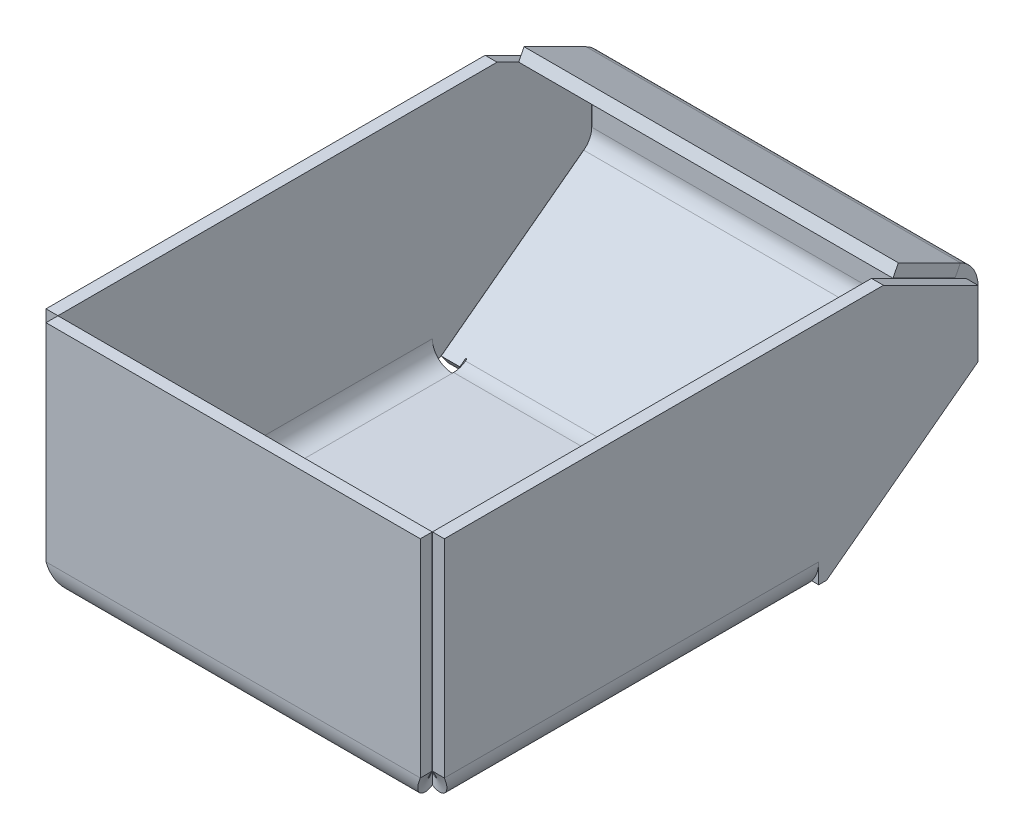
ISO-10303-21;
HEADER;
FILE_DESCRIPTION(('STEP AP214'),'2;1');
FILE_NAME('part.step','',(''),(''),'','','');
FILE_SCHEMA(('AUTOMOTIVE_DESIGN { 1 0 10303 214 1 1 1 1 }'));
ENDSEC;
DATA;
#1=APPLICATION_CONTEXT('core data for automotive mechanical design processes');
#2=APPLICATION_PROTOCOL_DEFINITION('international standard','automotive_design',2000,#1);
#3=PRODUCT_CONTEXT('',#1,'mechanical');
#4=PRODUCT('Part','Part','',(#3));
#5=PRODUCT_RELATED_PRODUCT_CATEGORY('part','',(#4));
#6=PRODUCT_DEFINITION_FORMATION('','',#4);
#7=PRODUCT_DEFINITION_CONTEXT('part definition',#1,'design');
#8=PRODUCT_DEFINITION('design','',#6,#7);
#9=PRODUCT_DEFINITION_SHAPE('','',#8);
#10=(LENGTH_UNIT() NAMED_UNIT(*) SI_UNIT(.MILLI.,.METRE.));
#11=(NAMED_UNIT(*) PLANE_ANGLE_UNIT() SI_UNIT($,.RADIAN.));
#12=(NAMED_UNIT(*) SI_UNIT($,.STERADIAN.) SOLID_ANGLE_UNIT());
#13=UNCERTAINTY_MEASURE_WITH_UNIT(LENGTH_MEASURE(1.E-05),#10,'distance_accuracy_value','');
#14=(GEOMETRIC_REPRESENTATION_CONTEXT(3) GLOBAL_UNCERTAINTY_ASSIGNED_CONTEXT((#13)) GLOBAL_UNIT_ASSIGNED_CONTEXT((#10,
#11,#12)) REPRESENTATION_CONTEXT('',''));
#15=CARTESIAN_POINT('',(0.,0.,0.));
#16=DIRECTION('',(0.,0.,1.));
#17=DIRECTION('',(1.,0.,0.));
#18=AXIS2_PLACEMENT_3D('',#15,#16,#17);
#19=CARTESIAN_POINT('',(1.5,1.5,-48.5));
#20=DIRECTION('',(0.,0.,1.));
#21=DIRECTION('',(-1.,0.,0.));
#22=AXIS2_PLACEMENT_3D('',#19,#20,#21);
#23=PLANE('',#22);
#24=CARTESIAN_POINT('',(4.,4.,-48.5));
#25=DIRECTION('',(0.,0.,1.));
#26=DIRECTION('',(1.,0.,0.));
#27=AXIS2_PLACEMENT_3D('',#24,#25,#26);
#28=CIRCLE('',#27,4.);
#29=CARTESIAN_POINT('',(0.,4.,-48.5));
#30=VERTEX_POINT('',#29);
#31=CARTESIAN_POINT('',(0.877501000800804,1.5,-48.5));
#32=VERTEX_POINT('',#31);
#33=EDGE_CURVE('E1095',#30,#32,#28,.T.);
#34=ORIENTED_EDGE('',*,*,#33,.F.);
#35=DIRECTION('',(0.,1.,0.));
#36=VECTOR('',#35,1.);
#37=CARTESIAN_POINT('',(0.,-0.749514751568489,-48.5));
#38=LINE('',#37,#36);
#39=CARTESIAN_POINT('',(0.,1.5,-48.5));
#40=VERTEX_POINT('',#39);
#41=EDGE_CURVE('E1066',#40,#30,#38,.T.);
#42=ORIENTED_EDGE('',*,*,#41,.F.);
#43=DIRECTION('',(-1.,0.,0.));
#44=VECTOR('',#43,1.);
#45=CARTESIAN_POINT('',(1.5,1.5,-48.5));
#46=LINE('',#45,#44);
#47=EDGE_CURVE('E1049',#32,#40,#46,.T.);
#48=ORIENTED_EDGE('',*,*,#47,.F.);
#49=EDGE_LOOP('',(#34,#42,#48));
#50=FACE_BOUND('',#49,.T.);
#51=ADVANCED_FACE('F31',(#50),#23,.T.);
#52=CARTESIAN_POINT('',(147.082559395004,30.,-60.));
#53=DIRECTION('',(0.,-1.,0.));
#54=DIRECTION('',(0.,0.,-1.));
#55=AXIS2_PLACEMENT_3D('',#52,#53,#54);
#56=PLANE('',#55);
#57=DIRECTION('',(-1.,0.,0.));
#58=VECTOR('',#57,1.);
#59=CARTESIAN_POINT('',(147.082559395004,30.,-56.6235373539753));
#60=LINE('',#59,#58);
#61=CARTESIAN_POINT('',(1.5,30.,-56.6235373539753));
#62=VERTEX_POINT('',#61);
#63=CARTESIAN_POINT('',(0.,30.,-56.6235373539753));
#64=VERTEX_POINT('',#63);
#65=EDGE_CURVE('E1084',#62,#64,#60,.T.);
#66=ORIENTED_EDGE('',*,*,#65,.T.);
#67=DIRECTION('',(0.,0.,1.));
#68=VECTOR('',#67,1.);
#69=CARTESIAN_POINT('',(0.,30.,-60.));
#70=LINE('',#69,#68);
#71=CARTESIAN_POINT('',(0.,30.,-1.51));
#72=VERTEX_POINT('',#71);
#73=EDGE_CURVE('E1081',#64,#72,#70,.T.);
#74=ORIENTED_EDGE('',*,*,#73,.T.);
#75=DIRECTION('',(-1.,0.,0.));
#76=VECTOR('',#75,1.);
#77=CARTESIAN_POINT('',(147.082559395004,30.,-1.51));
#78=LINE('',#77,#76);
#79=CARTESIAN_POINT('',(1.5,30.,-1.51));
#80=VERTEX_POINT('',#79);
#81=EDGE_CURVE('E1044',#80,#72,#78,.T.);
#82=ORIENTED_EDGE('',*,*,#81,.F.);
#83=DIRECTION('',(0.,0.,1.));
#84=VECTOR('',#83,1.);
#85=CARTESIAN_POINT('',(1.5,30.,-60.));
#86=LINE('',#85,#84);
#87=EDGE_CURVE('E11',#62,#80,#86,.T.);
#88=ORIENTED_EDGE('',*,*,#87,.F.);
#89=EDGE_LOOP('',(#66,#74,#82,#88));
#90=FACE_BOUND('',#89,.T.);
#91=ADVANCED_FACE('F1012',(#90),#56,.F.);
#92=CARTESIAN_POINT('',(147.082559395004,24.0667686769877,-68.49));
#93=DIRECTION('',(0.,-0.894427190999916,0.447213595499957));
#94=DIRECTION('',(0.,-0.447213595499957,-0.894427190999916));
#95=AXIS2_PLACEMENT_3D('',#92,#93,#94);
#96=PLANE('',#95);
#97=DIRECTION('',(-1.,0.,0.));
#98=VECTOR('',#97,1.);
#99=CARTESIAN_POINT('',(147.082559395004,24.0667686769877,-68.49));
#100=LINE('',#99,#98);
#101=CARTESIAN_POINT('',(1.5,24.0667686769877,-68.49));
#102=VERTEX_POINT('',#101);
#103=CARTESIAN_POINT('',(0.,24.0667686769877,-68.49));
#104=VERTEX_POINT('',#103);
#105=EDGE_CURVE('E1079',#102,#104,#100,.T.);
#106=ORIENTED_EDGE('',*,*,#105,.T.);
#107=DIRECTION('',(0.,0.447213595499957,0.894427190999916));
#108=VECTOR('',#107,1.);
#109=CARTESIAN_POINT('',(0.,24.0667686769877,-68.49));
#110=LINE('',#109,#108);
#111=EDGE_CURVE('E100',#104,#64,#110,.T.);
#112=ORIENTED_EDGE('',*,*,#111,.T.);
#113=ORIENTED_EDGE('',*,*,#65,.F.);
#114=DIRECTION('',(0.,0.447213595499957,0.894427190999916));
#115=VECTOR('',#114,1.);
#116=CARTESIAN_POINT('',(1.5,24.0667686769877,-68.49));
#117=LINE('',#116,#115);
#118=EDGE_CURVE('E41',#102,#62,#117,.T.);
#119=ORIENTED_EDGE('',*,*,#118,.F.);
#120=EDGE_LOOP('',(#106,#112,#113,#119));
#121=FACE_BOUND('',#120,.T.);
#122=ADVANCED_FACE('F1016',(#121),#96,.F.);
#123=CARTESIAN_POINT('',(147.082559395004,15.755,-68.49));
#124=DIRECTION('',(0.,0.,1.));
#125=DIRECTION('',(0.,-1.,0.));
#126=AXIS2_PLACEMENT_3D('',#123,#124,#125);
#127=PLANE('',#126);
#128=DIRECTION('',(-1.,0.,0.));
#129=VECTOR('',#128,1.);
#130=CARTESIAN_POINT('',(147.082559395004,15.755,-68.49));
#131=LINE('',#130,#129);
#132=CARTESIAN_POINT('',(1.5,15.755,-68.49));
#133=VERTEX_POINT('',#132);
#134=CARTESIAN_POINT('',(0.,15.755,-68.49));
#135=VERTEX_POINT('',#134);
#136=EDGE_CURVE('E1076',#133,#135,#131,.T.);
#137=ORIENTED_EDGE('',*,*,#136,.T.);
#138=DIRECTION('',(0.,1.,0.));
#139=VECTOR('',#138,1.);
#140=CARTESIAN_POINT('',(0.,15.755,-68.49));
#141=LINE('',#140,#139);
#142=EDGE_CURVE('E94',#135,#104,#141,.T.);
#143=ORIENTED_EDGE('',*,*,#142,.T.);
#144=ORIENTED_EDGE('',*,*,#105,.F.);
#145=DIRECTION('',(0.,1.,0.));
#146=VECTOR('',#145,1.);
#147=CARTESIAN_POINT('',(1.5,15.755,-68.49));
#148=LINE('',#147,#146);
#149=EDGE_CURVE('E1057',#133,#102,#148,.T.);
#150=ORIENTED_EDGE('',*,*,#149,.F.);
#151=EDGE_LOOP('',(#137,#143,#144,#150));
#152=FACE_BOUND('',#151,.T.);
#153=ADVANCED_FACE('F1020',(#152),#127,.F.);
#154=CARTESIAN_POINT('',(147.082559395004,1.5,-49.4833333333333));
#155=DIRECTION('',(0.,0.799999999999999,0.600000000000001));
#156=DIRECTION('',(0.,-0.600000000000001,0.799999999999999));
#157=AXIS2_PLACEMENT_3D('',#154,#155,#156);
#158=PLANE('',#157);
#159=DIRECTION('',(-1.,0.,0.));
#160=VECTOR('',#159,1.);
#161=CARTESIAN_POINT('',(147.082559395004,1.5,-49.4833333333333));
#162=LINE('',#161,#160);
#163=CARTESIAN_POINT('',(1.5,1.5,-49.4833333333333));
#164=VERTEX_POINT('',#163);
#165=CARTESIAN_POINT('',(0.,1.5,-49.4833333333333));
#166=VERTEX_POINT('',#165);
#167=EDGE_CURVE('E1072',#164,#166,#162,.T.);
#168=ORIENTED_EDGE('',*,*,#167,.T.);
#169=DIRECTION('',(0.,0.600000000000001,-0.8));
#170=VECTOR('',#169,1.);
#171=CARTESIAN_POINT('',(0.,0.,-47.4833333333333));
#172=LINE('',#171,#170);
#173=EDGE_CURVE('E1045',#166,#135,#172,.T.);
#174=ORIENTED_EDGE('',*,*,#173,.T.);
#175=ORIENTED_EDGE('',*,*,#136,.F.);
#176=DIRECTION('',(0.,0.600000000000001,-0.799999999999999));
#177=VECTOR('',#176,1.);
#178=CARTESIAN_POINT('',(1.5,1.5,-49.4833333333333));
#179=LINE('',#178,#177);
#180=EDGE_CURVE('E1059',#164,#133,#179,.T.);
#181=ORIENTED_EDGE('',*,*,#180,.F.);
#182=EDGE_LOOP('',(#168,#174,#175,#181));
#183=FACE_BOUND('',#182,.T.);
#184=ADVANCED_FACE('F1023',(#183),#158,.F.);
#185=CARTESIAN_POINT('',(147.082559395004,1.5,-1.51));
#186=DIRECTION('',(0.,0.,1.));
#187=DIRECTION('',(0.,-1.,0.));
#188=AXIS2_PLACEMENT_3D('',#185,#186,#187);
#189=PLANE('',#188);
#190=DIRECTION('',(0.,1.,0.));
#191=VECTOR('',#190,1.);
#192=CARTESIAN_POINT('',(0.,1.5,-1.51));
#193=LINE('',#192,#191);
#194=CARTESIAN_POINT('',(0.,4.,-1.51));
#195=VERTEX_POINT('',#194);
#196=EDGE_CURVE('E1065',#195,#72,#193,.T.);
#197=ORIENTED_EDGE('',*,*,#196,.F.);
#198=CARTESIAN_POINT('',(1.5,4.,-1.51000000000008));
#199=CARTESIAN_POINT('',(0.,4.,-1.51000000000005));
#200=B_SPLINE_CURVE_WITH_KNOTS('',1,(#198,#199),.UNSPECIFIED.,.F.,.F.,(2,2),(0.,1.),.UNSPECIFIED.);
#201=CARTESIAN_POINT('',(1.5,4.,-1.51));
#202=VERTEX_POINT('',#201);
#203=EDGE_CURVE('E107',#202,#195,#200,.T.);
#204=ORIENTED_EDGE('',*,*,#203,.F.);
#205=DIRECTION('',(0.,1.,0.));
#206=VECTOR('',#205,1.);
#207=CARTESIAN_POINT('',(1.5,1.5,-1.51));
#208=LINE('',#207,#206);
#209=EDGE_CURVE('E1037',#202,#80,#208,.T.);
#210=ORIENTED_EDGE('',*,*,#209,.T.);
#211=ORIENTED_EDGE('',*,*,#81,.T.);
#212=EDGE_LOOP('',(#197,#204,#210,#211));
#213=FACE_BOUND('',#212,.T.);
#214=ADVANCED_FACE('F1026',(#213),#189,.T.);
#215=CARTESIAN_POINT('',(0.,0.,0.));
#216=DIRECTION('',(1.,0.,0.));
#217=DIRECTION('',(0.,0.,-1.));
#218=AXIS2_PLACEMENT_3D('',#215,#216,#217);
#219=PLANE('',#218);
#220=ORIENTED_EDGE('',*,*,#41,.T.);
#221=DIRECTION('',(0.,0.,1.));
#222=VECTOR('',#221,1.);
#223=CARTESIAN_POINT('',(0.,4.,-48.5));
#224=LINE('',#223,#222);
#225=EDGE_CURVE('E1069',#30,#195,#224,.T.);
#226=ORIENTED_EDGE('',*,*,#225,.T.);
#227=ORIENTED_EDGE('',*,*,#196,.T.);
#228=ORIENTED_EDGE('',*,*,#73,.F.);
#229=ORIENTED_EDGE('',*,*,#111,.F.);
#230=ORIENTED_EDGE('',*,*,#142,.F.);
#231=ORIENTED_EDGE('',*,*,#173,.F.);
#232=DIRECTION('',(0.,0.,1.));
#233=VECTOR('',#232,1.);
#234=CARTESIAN_POINT('',(0.,1.5,0.));
#235=LINE('',#234,#233);
#236=EDGE_CURVE('E1063',#166,#40,#235,.T.);
#237=ORIENTED_EDGE('',*,*,#236,.T.);
#238=EDGE_LOOP('',(#220,#226,#227,#228,#229,#230,#231,#237));
#239=FACE_BOUND('',#238,.T.);
#240=ADVANCED_FACE('F1031',(#239),#219,.F.);
#241=CARTESIAN_POINT('',(147.082559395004,1.5,0.));
#242=DIRECTION('',(0.,-1.,0.));
#243=DIRECTION('',(1.,0.,0.));
#244=AXIS2_PLACEMENT_3D('',#241,#242,#243);
#245=PLANE('',#244);
#246=ORIENTED_EDGE('',*,*,#236,.F.);
#247=ORIENTED_EDGE('',*,*,#167,.F.);
#248=DIRECTION('',(0.,0.,1.));
#249=VECTOR('',#248,1.);
#250=CARTESIAN_POINT('',(1.5,1.5,0.));
#251=LINE('',#250,#249);
#252=CARTESIAN_POINT('',(1.5,1.5,-48.5));
#253=VERTEX_POINT('',#252);
#254=EDGE_CURVE('E1061',#164,#253,#251,.T.);
#255=ORIENTED_EDGE('',*,*,#254,.T.);
#256=EDGE_CURVE('E114',#253,#32,#46,.T.);
#257=ORIENTED_EDGE('',*,*,#256,.T.);
#258=ORIENTED_EDGE('',*,*,#47,.T.);
#259=EDGE_LOOP('',(#246,#247,#255,#257,#258));
#260=FACE_BOUND('',#259,.T.);
#261=ADVANCED_FACE('F1540',(#260),#245,.T.);
#262=CARTESIAN_POINT('',(1.5,0.,0.));
#263=DIRECTION('',(1.,0.,0.));
#264=DIRECTION('',(0.,0.,-1.));
#265=AXIS2_PLACEMENT_3D('',#262,#263,#264);
#266=PLANE('',#265);
#267=DIRECTION('',(0.,0.,1.));
#268=VECTOR('',#267,1.);
#269=CARTESIAN_POINT('',(1.5,4.,-48.5));
#270=LINE('',#269,#268);
#271=CARTESIAN_POINT('',(1.5,4.,-48.5));
#272=VERTEX_POINT('',#271);
#273=EDGE_CURVE('E50',#272,#202,#270,.T.);
#274=ORIENTED_EDGE('',*,*,#273,.F.);
#275=DIRECTION('',(0.,1.,0.));
#276=VECTOR('',#275,1.);
#277=CARTESIAN_POINT('',(1.5,1.5,-48.5));
#278=LINE('',#277,#276);
#279=EDGE_CURVE('E1052',#253,#272,#278,.T.);
#280=ORIENTED_EDGE('',*,*,#279,.F.);
#281=ORIENTED_EDGE('',*,*,#254,.F.);
#282=ORIENTED_EDGE('',*,*,#180,.T.);
#283=ORIENTED_EDGE('',*,*,#149,.T.);
#284=ORIENTED_EDGE('',*,*,#118,.T.);
#285=ORIENTED_EDGE('',*,*,#87,.T.);
#286=ORIENTED_EDGE('',*,*,#209,.F.);
#287=EDGE_LOOP('',(#274,#280,#281,#282,#283,#284,#285,#286));
#288=FACE_BOUND('',#287,.T.);
#289=ADVANCED_FACE('F33',(#288),#266,.T.);
#290=CARTESIAN_POINT('',(4.,4.,-48.5));
#291=DIRECTION('',(0.,0.,1.));
#292=DIRECTION('',(0.,-1.,0.));
#293=AXIS2_PLACEMENT_3D('',#290,#291,#292);
#294=PLANE('',#293);
#295=ORIENTED_EDGE('',*,*,#256,.F.);
#296=ORIENTED_EDGE('',*,*,#279,.T.);
#297=CARTESIAN_POINT('',(4.,4.,-48.5));
#298=DIRECTION('',(0.,0.,1.));
#299=DIRECTION('',(1.,0.,0.));
#300=AXIS2_PLACEMENT_3D('',#297,#298,#299);
#301=CIRCLE('',#300,2.5);
#302=CARTESIAN_POINT('',(4.,1.5,-48.5));
#303=VERTEX_POINT('',#302);
#304=EDGE_CURVE('E405',#303,#272,#301,.F.);
#305=ORIENTED_EDGE('',*,*,#304,.F.);
#306=DIRECTION('',(0.,-1.,0.));
#307=VECTOR('',#306,1.);
#308=CARTESIAN_POINT('',(4.,124.123180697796,-48.5));
#309=LINE('',#308,#307);
#310=CARTESIAN_POINT('',(4.,0.,-48.5));
#311=VERTEX_POINT('',#310);
#312=EDGE_CURVE('E400',#303,#311,#309,.T.);
#313=ORIENTED_EDGE('',*,*,#312,.T.);
#314=EDGE_CURVE('E399',#32,#311,#28,.T.);
#315=ORIENTED_EDGE('',*,*,#314,.F.);
#316=EDGE_LOOP('',(#295,#296,#305,#313,#315));
#317=FACE_BOUND('',#316,.T.);
#318=ADVANCED_FACE('F429',(#317),#294,.F.);
#319=CARTESIAN_POINT('',(48.5,4.,-48.5));
#320=DIRECTION('',(0.,0.,1.));
#321=DIRECTION('',(1.,0.,0.));
#322=AXIS2_PLACEMENT_3D('',#319,#320,#321);
#323=PLANE('',#322);
#324=DIRECTION('',(0.,-1.,0.));
#325=VECTOR('',#324,1.);
#326=CARTESIAN_POINT('',(50.,-0.749514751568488,-48.5));
#327=LINE('',#326,#325);
#328=CARTESIAN_POINT('',(50.,4.00000000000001,-48.5));
#329=VERTEX_POINT('',#328);
#330=CARTESIAN_POINT('',(50.,1.50000000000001,-48.5));
#331=VERTEX_POINT('',#330);
#332=EDGE_CURVE('E939',#329,#331,#327,.T.);
#333=ORIENTED_EDGE('',*,*,#332,.F.);
#334=CARTESIAN_POINT('',(46.,4.,-48.5));
#335=DIRECTION('',(0.,0.,-1.));
#336=DIRECTION('',(-1.,0.,0.));
#337=AXIS2_PLACEMENT_3D('',#334,#335,#336);
#338=CIRCLE('',#337,4.);
#339=CARTESIAN_POINT('',(49.1224989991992,1.5,-48.5));
#340=VERTEX_POINT('',#339);
#341=EDGE_CURVE('E462',#329,#340,#338,.T.);
#342=ORIENTED_EDGE('',*,*,#341,.T.);
#343=DIRECTION('',(1.,0.,0.));
#344=VECTOR('',#343,1.);
#345=CARTESIAN_POINT('',(48.5,1.5,-48.5));
#346=LINE('',#345,#344);
#347=EDGE_CURVE('E918',#340,#331,#346,.T.);
#348=ORIENTED_EDGE('',*,*,#347,.T.);
#349=EDGE_LOOP('',(#333,#342,#348));
#350=FACE_BOUND('',#349,.T.);
#351=ADVANCED_FACE('F1519',(#350),#323,.T.);
#352=CARTESIAN_POINT('',(-97.0825593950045,1.5,-49.4833333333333));
#353=DIRECTION('',(0.,-0.799999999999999,-0.600000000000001));
#354=DIRECTION('',(0.,-0.600000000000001,0.799999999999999));
#355=AXIS2_PLACEMENT_3D('',#352,#353,#354);
#356=PLANE('',#355);
#357=DIRECTION('',(1.,0.,0.));
#358=VECTOR('',#357,1.);
#359=CARTESIAN_POINT('',(-97.0825593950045,15.755,-68.49));
#360=LINE('',#359,#358);
#361=CARTESIAN_POINT('',(48.5,15.755,-68.49));
#362=VERTEX_POINT('',#361);
#363=CARTESIAN_POINT('',(50.,15.755,-68.49));
#364=VERTEX_POINT('',#363);
#365=EDGE_CURVE('E967',#362,#364,#360,.T.);
#366=ORIENTED_EDGE('',*,*,#365,.T.);
#367=DIRECTION('',(0.,0.600000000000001,-0.799999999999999));
#368=VECTOR('',#367,1.);
#369=CARTESIAN_POINT('',(50.,0.,-47.4833333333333));
#370=LINE('',#369,#368);
#371=CARTESIAN_POINT('',(50.,1.5,-49.4833333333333));
#372=VERTEX_POINT('',#371);
#373=EDGE_CURVE('E933',#372,#364,#370,.T.);
#374=ORIENTED_EDGE('',*,*,#373,.F.);
#375=DIRECTION('',(1.,0.,0.));
#376=VECTOR('',#375,1.);
#377=CARTESIAN_POINT('',(-97.0825593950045,1.5,-49.4833333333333));
#378=LINE('',#377,#376);
#379=CARTESIAN_POINT('',(48.5,1.50000000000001,-49.4833333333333));
#380=VERTEX_POINT('',#379);
#381=EDGE_CURVE('E942',#380,#372,#378,.T.);
#382=ORIENTED_EDGE('',*,*,#381,.F.);
#383=DIRECTION('',(0.,0.600000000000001,-0.799999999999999));
#384=VECTOR('',#383,1.);
#385=CARTESIAN_POINT('',(48.5,1.50000000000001,-49.4833333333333));
#386=LINE('',#385,#384);
#387=EDGE_CURVE('E964',#380,#362,#386,.T.);
#388=ORIENTED_EDGE('',*,*,#387,.T.);
#389=EDGE_LOOP('',(#366,#374,#382,#388));
#390=FACE_BOUND('',#389,.T.);
#391=ADVANCED_FACE('F1511',(#390),#356,.T.);
#392=CARTESIAN_POINT('',(-97.0825593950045,15.755,-68.49));
#393=DIRECTION('',(0.,0.,-1.));
#394=DIRECTION('',(0.,-1.,0.));
#395=AXIS2_PLACEMENT_3D('',#392,#393,#394);
#396=PLANE('',#395);
#397=DIRECTION('',(1.,0.,0.));
#398=VECTOR('',#397,1.);
#399=CARTESIAN_POINT('',(-97.0825593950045,24.0667686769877,-68.49));
#400=LINE('',#399,#398);
#401=CARTESIAN_POINT('',(48.5,24.0667686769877,-68.49));
#402=VERTEX_POINT('',#401);
#403=CARTESIAN_POINT('',(50.,24.0667686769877,-68.49));
#404=VERTEX_POINT('',#403);
#405=EDGE_CURVE('E961',#402,#404,#400,.T.);
#406=ORIENTED_EDGE('',*,*,#405,.T.);
#407=DIRECTION('',(0.,1.,0.));
#408=VECTOR('',#407,1.);
#409=CARTESIAN_POINT('',(50.,15.755,-68.49));
#410=LINE('',#409,#408);
#411=EDGE_CURVE('E930',#364,#404,#410,.T.);
#412=ORIENTED_EDGE('',*,*,#411,.F.);
#413=ORIENTED_EDGE('',*,*,#365,.F.);
#414=DIRECTION('',(0.,1.,0.));
#415=VECTOR('',#414,1.);
#416=CARTESIAN_POINT('',(48.5,15.755,-68.49));
#417=LINE('',#416,#415);
#418=EDGE_CURVE('E958',#362,#402,#417,.T.);
#419=ORIENTED_EDGE('',*,*,#418,.T.);
#420=EDGE_LOOP('',(#406,#412,#413,#419));
#421=FACE_BOUND('',#420,.T.);
#422=ADVANCED_FACE('F1504',(#421),#396,.T.);
#423=CARTESIAN_POINT('',(-97.0825593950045,24.0667686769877,-68.49));
#424=DIRECTION('',(0.,0.894427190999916,-0.447213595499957));
#425=DIRECTION('',(0.,-0.447213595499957,-0.894427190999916));
#426=AXIS2_PLACEMENT_3D('',#423,#424,#425);
#427=PLANE('',#426);
#428=DIRECTION('',(1.,0.,0.));
#429=VECTOR('',#428,1.);
#430=CARTESIAN_POINT('',(-97.0825593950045,30.,-56.6235373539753));
#431=LINE('',#430,#429);
#432=CARTESIAN_POINT('',(48.5,30.,-56.6235373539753));
#433=VERTEX_POINT('',#432);
#434=CARTESIAN_POINT('',(50.,30.,-56.6235373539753));
#435=VERTEX_POINT('',#434);
#436=EDGE_CURVE('E955',#433,#435,#431,.T.);
#437=ORIENTED_EDGE('',*,*,#436,.T.);
#438=DIRECTION('',(0.,0.447213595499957,0.894427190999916));
#439=VECTOR('',#438,1.);
#440=CARTESIAN_POINT('',(50.,24.0667686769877,-68.49));
#441=LINE('',#440,#439);
#442=EDGE_CURVE('E927',#404,#435,#441,.T.);
#443=ORIENTED_EDGE('',*,*,#442,.F.);
#444=ORIENTED_EDGE('',*,*,#405,.F.);
#445=DIRECTION('',(0.,0.447213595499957,0.894427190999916));
#446=VECTOR('',#445,1.);
#447=CARTESIAN_POINT('',(48.5,24.0667686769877,-68.49));
#448=LINE('',#447,#446);
#449=EDGE_CURVE('E952',#402,#433,#448,.T.);
#450=ORIENTED_EDGE('',*,*,#449,.T.);
#451=EDGE_LOOP('',(#437,#443,#444,#450));
#452=FACE_BOUND('',#451,.T.);
#453=ADVANCED_FACE('F1497',(#452),#427,.T.);
#454=CARTESIAN_POINT('',(-97.0825593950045,30.,-60.));
#455=DIRECTION('',(0.,1.,0.));
#456=DIRECTION('',(0.,0.,-1.));
#457=AXIS2_PLACEMENT_3D('',#454,#455,#456);
#458=PLANE('',#457);
#459=DIRECTION('',(1.,0.,0.));
#460=VECTOR('',#459,1.);
#461=CARTESIAN_POINT('',(-97.0825593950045,30.,-1.51));
#462=LINE('',#461,#460);
#463=CARTESIAN_POINT('',(48.5,30.,-1.51));
#464=VERTEX_POINT('',#463);
#465=CARTESIAN_POINT('',(50.,30.,-1.51));
#466=VERTEX_POINT('',#465);
#467=EDGE_CURVE('E949',#464,#466,#462,.T.);
#468=ORIENTED_EDGE('',*,*,#467,.T.);
#469=DIRECTION('',(0.,0.,1.));
#470=VECTOR('',#469,1.);
#471=CARTESIAN_POINT('',(50.,30.,-60.));
#472=LINE('',#471,#470);
#473=EDGE_CURVE('E924',#435,#466,#472,.T.);
#474=ORIENTED_EDGE('',*,*,#473,.F.);
#475=ORIENTED_EDGE('',*,*,#436,.F.);
#476=DIRECTION('',(0.,0.,1.));
#477=VECTOR('',#476,1.);
#478=CARTESIAN_POINT('',(48.5,30.,-60.));
#479=LINE('',#478,#477);
#480=EDGE_CURVE('E946',#433,#464,#479,.T.);
#481=ORIENTED_EDGE('',*,*,#480,.T.);
#482=EDGE_LOOP('',(#468,#474,#475,#481));
#483=FACE_BOUND('',#482,.T.);
#484=ADVANCED_FACE('F996',(#483),#458,.T.);
#485=CARTESIAN_POINT('',(-97.0825593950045,1.5,-1.51));
#486=DIRECTION('',(0.,0.,-1.));
#487=DIRECTION('',(0.,-1.,0.));
#488=AXIS2_PLACEMENT_3D('',#485,#486,#487);
#489=PLANE('',#488);
#490=DIRECTION('',(0.,1.,0.));
#491=VECTOR('',#490,1.);
#492=CARTESIAN_POINT('',(50.,0.,-1.50999999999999));
#493=LINE('',#492,#491);
#494=CARTESIAN_POINT('',(50.,4.,-1.51000000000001));
#495=VERTEX_POINT('',#494);
#496=EDGE_CURVE('E945',#495,#466,#493,.T.);
#497=ORIENTED_EDGE('',*,*,#496,.T.);
#498=ORIENTED_EDGE('',*,*,#467,.F.);
#499=DIRECTION('',(0.,1.,0.));
#500=VECTOR('',#499,1.);
#501=CARTESIAN_POINT('',(48.5,1.50000000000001,-1.51));
#502=LINE('',#501,#500);
#503=CARTESIAN_POINT('',(48.5,4.,-1.51000000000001));
#504=VERTEX_POINT('',#503);
#505=EDGE_CURVE('E923',#504,#464,#502,.T.);
#506=ORIENTED_EDGE('',*,*,#505,.F.);
#507=CARTESIAN_POINT('',(50.,4.,-1.51000000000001));
#508=CARTESIAN_POINT('',(48.5,4.,-1.51000000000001));
#509=B_SPLINE_CURVE_WITH_KNOTS('',1,(#507,#508),.UNSPECIFIED.,.F.,.F.,(2,2),(0.,1.),.UNSPECIFIED.);
#510=EDGE_CURVE('E525',#504,#495,#509,.F.);
#511=ORIENTED_EDGE('',*,*,#510,.T.);
#512=EDGE_LOOP('',(#497,#498,#506,#511));
#513=FACE_BOUND('',#512,.T.);
#514=ADVANCED_FACE('F985',(#513),#489,.F.);
#515=CARTESIAN_POINT('',(-97.0825593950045,1.5,0.));
#516=DIRECTION('',(0.,1.,0.));
#517=DIRECTION('',(-1.,0.,0.));
#518=AXIS2_PLACEMENT_3D('',#515,#516,#517);
#519=PLANE('',#518);
#520=DIRECTION('',(0.,0.,-1.));
#521=VECTOR('',#520,1.);
#522=CARTESIAN_POINT('',(50.,1.50000000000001,-48.5));
#523=LINE('',#522,#521);
#524=EDGE_CURVE('E936',#331,#372,#523,.T.);
#525=ORIENTED_EDGE('',*,*,#524,.F.);
#526=ORIENTED_EDGE('',*,*,#347,.F.);
#527=CARTESIAN_POINT('',(48.5,1.5,-48.5));
#528=VERTEX_POINT('',#527);
#529=EDGE_CURVE('E669',#528,#340,#346,.T.);
#530=ORIENTED_EDGE('',*,*,#529,.F.);
#531=DIRECTION('',(0.,0.,1.));
#532=VECTOR('',#531,1.);
#533=CARTESIAN_POINT('',(48.5,1.50000000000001,0.));
#534=LINE('',#533,#532);
#535=EDGE_CURVE('E920',#380,#528,#534,.T.);
#536=ORIENTED_EDGE('',*,*,#535,.F.);
#537=ORIENTED_EDGE('',*,*,#381,.T.);
#538=EDGE_LOOP('',(#525,#526,#530,#536,#537));
#539=FACE_BOUND('',#538,.T.);
#540=ADVANCED_FACE('F995',(#539),#519,.F.);
#541=CARTESIAN_POINT('',(50.,0.,0.));
#542=DIRECTION('',(1.,0.,0.));
#543=DIRECTION('',(0.,0.,-1.));
#544=AXIS2_PLACEMENT_3D('',#541,#542,#543);
#545=PLANE('',#544);
#546=DIRECTION('',(0.,0.,1.));
#547=VECTOR('',#546,1.);
#548=CARTESIAN_POINT('',(50.,4.,-1.51));
#549=LINE('',#548,#547);
#550=EDGE_CURVE('E661',#329,#495,#549,.T.);
#551=ORIENTED_EDGE('',*,*,#550,.F.);
#552=ORIENTED_EDGE('',*,*,#332,.T.);
#553=ORIENTED_EDGE('',*,*,#524,.T.);
#554=ORIENTED_EDGE('',*,*,#373,.T.);
#555=ORIENTED_EDGE('',*,*,#411,.T.);
#556=ORIENTED_EDGE('',*,*,#442,.T.);
#557=ORIENTED_EDGE('',*,*,#473,.T.);
#558=ORIENTED_EDGE('',*,*,#496,.F.);
#559=EDGE_LOOP('',(#551,#552,#553,#554,#555,#556,#557,#558));
#560=FACE_BOUND('',#559,.T.);
#561=ADVANCED_FACE('F1000',(#560),#545,.T.);
#562=CARTESIAN_POINT('',(48.5,0.,0.));
#563=DIRECTION('',(1.,0.,0.));
#564=DIRECTION('',(0.,0.,-1.));
#565=AXIS2_PLACEMENT_3D('',#562,#563,#564);
#566=PLANE('',#565);
#567=DIRECTION('',(0.,-1.,0.));
#568=VECTOR('',#567,1.);
#569=CARTESIAN_POINT('',(48.5,4.,-48.5));
#570=LINE('',#569,#568);
#571=CARTESIAN_POINT('',(48.5,4.00000000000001,-48.5));
#572=VERTEX_POINT('',#571);
#573=EDGE_CURVE('E888',#572,#528,#570,.T.);
#574=ORIENTED_EDGE('',*,*,#573,.F.);
#575=DIRECTION('',(0.,0.,-1.));
#576=VECTOR('',#575,1.);
#577=CARTESIAN_POINT('',(48.5,4.,-1.51));
#578=LINE('',#577,#576);
#579=EDGE_CURVE('E970',#504,#572,#578,.T.);
#580=ORIENTED_EDGE('',*,*,#579,.F.);
#581=ORIENTED_EDGE('',*,*,#505,.T.);
#582=ORIENTED_EDGE('',*,*,#480,.F.);
#583=ORIENTED_EDGE('',*,*,#449,.F.);
#584=ORIENTED_EDGE('',*,*,#418,.F.);
#585=ORIENTED_EDGE('',*,*,#387,.F.);
#586=ORIENTED_EDGE('',*,*,#535,.T.);
#587=EDGE_LOOP('',(#574,#580,#581,#582,#583,#584,#585,#586));
#588=FACE_BOUND('',#587,.T.);
#589=ADVANCED_FACE('F1004',(#588),#566,.F.);
#590=CARTESIAN_POINT('',(50.,-56.8135677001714,-16.5932161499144));
#591=DIRECTION('',(0.,-0.447213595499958,-0.894427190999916));
#592=DIRECTION('',(0.,0.894427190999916,-0.447213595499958));
#593=AXIS2_PLACEMENT_3D('',#590,#591,#592);
#594=PLANE('',#593);
#595=DIRECTION('',(0.,0.894427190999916,-0.447213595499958));
#596=VECTOR('',#595,1.);
#597=CARTESIAN_POINT('',(48.49,-56.8135677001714,-16.5932161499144));
#598=LINE('',#597,#596);
#599=CARTESIAN_POINT('',(48.49,28.6583592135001,-59.32917960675));
#600=VERTEX_POINT('',#599);
#601=CARTESIAN_POINT('',(48.49,30.,-60.));
#602=VERTEX_POINT('',#601);
#603=EDGE_CURVE('E910',#600,#602,#598,.T.);
#604=ORIENTED_EDGE('',*,*,#603,.T.);
#605=DIRECTION('',(-1.,0.,0.));
#606=VECTOR('',#605,1.);
#607=CARTESIAN_POINT('',(50.,30.,-60.));
#608=LINE('',#607,#606);
#609=CARTESIAN_POINT('',(1.51,30.,-60.));
#610=VERTEX_POINT('',#609);
#611=EDGE_CURVE('E907',#602,#610,#608,.T.);
#612=ORIENTED_EDGE('',*,*,#611,.T.);
#613=DIRECTION('',(0.,0.894427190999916,-0.447213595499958));
#614=VECTOR('',#613,1.);
#615=CARTESIAN_POINT('',(1.51,-56.8135677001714,-16.5932161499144));
#616=LINE('',#615,#614);
#617=CARTESIAN_POINT('',(1.51,28.6583592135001,-59.32917960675));
#618=VERTEX_POINT('',#617);
#619=EDGE_CURVE('E891',#618,#610,#616,.T.);
#620=ORIENTED_EDGE('',*,*,#619,.F.);
#621=DIRECTION('',(-1.,0.,0.));
#622=VECTOR('',#621,1.);
#623=CARTESIAN_POINT('',(50.,28.6583592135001,-59.32917960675));
#624=LINE('',#623,#622);
#625=EDGE_CURVE('E886',#600,#618,#624,.T.);
#626=ORIENTED_EDGE('',*,*,#625,.F.);
#627=EDGE_LOOP('',(#604,#612,#620,#626));
#628=FACE_BOUND('',#627,.T.);
#629=ADVANCED_FACE('F1008',(#628),#594,.F.);
#630=CARTESIAN_POINT('',(48.49,-61.3989778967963,-25.7640365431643));
#631=DIRECTION('',(-1.,0.,0.));
#632=DIRECTION('',(0.,-0.447213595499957,-0.894427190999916));
#633=AXIS2_PLACEMENT_3D('',#630,#631,#632);
#634=PLANE('',#633);
#635=DIRECTION('',(0.,0.894427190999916,-0.447213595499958));
#636=VECTOR('',#635,1.);
#637=CARTESIAN_POINT('',(48.49,-60.7079948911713,-24.3820705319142));
#638=LINE('',#637,#636);
#639=CARTESIAN_POINT('',(48.49,24.7639320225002,-67.1180339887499));
#640=VERTEX_POINT('',#639);
#641=CARTESIAN_POINT('',(48.49,26.1055728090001,-67.7888543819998));
#642=VERTEX_POINT('',#641);
#643=EDGE_CURVE('E904',#640,#642,#638,.T.);
#644=ORIENTED_EDGE('',*,*,#643,.T.);
#645=DIRECTION('',(0.,0.447213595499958,0.894427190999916));
#646=VECTOR('',#645,1.);
#647=CARTESIAN_POINT('',(48.49,25.,-70.));
#648=LINE('',#647,#646);
#649=EDGE_CURVE('E902',#642,#602,#648,.T.);
#650=ORIENTED_EDGE('',*,*,#649,.T.);
#651=ORIENTED_EDGE('',*,*,#603,.F.);
#652=DIRECTION('',(0.,0.447213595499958,0.894427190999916));
#653=VECTOR('',#652,1.);
#654=CARTESIAN_POINT('',(48.49,24.0729490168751,-68.5));
#655=LINE('',#654,#653);
#656=EDGE_CURVE('E889',#640,#600,#655,.T.);
#657=ORIENTED_EDGE('',*,*,#656,.F.);
#658=EDGE_LOOP('',(#644,#650,#651,#657));
#659=FACE_BOUND('',#658,.T.);
#660=ADVANCED_FACE('F1459',(#659),#634,.F.);
#661=CARTESIAN_POINT('',(50.,30.,-60.));
#662=DIRECTION('',(0.,-0.894427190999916,0.447213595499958));
#663=DIRECTION('',(0.,-0.447213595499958,-0.894427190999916));
#664=AXIS2_PLACEMENT_3D('',#661,#662,#663);
#665=PLANE('',#664);
#666=ORIENTED_EDGE('',*,*,#649,.F.);
#667=DIRECTION('',(-1.,0.,0.));
#668=VECTOR('',#667,1.);
#669=CARTESIAN_POINT('',(48.49,26.1055728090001,-67.7888543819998));
#670=LINE('',#669,#668);
#671=CARTESIAN_POINT('',(1.51,26.1055728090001,-67.7888543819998));
#672=VERTEX_POINT('',#671);
#673=EDGE_CURVE('E899',#642,#672,#670,.T.);
#674=ORIENTED_EDGE('',*,*,#673,.T.);
#675=DIRECTION('',(0.,0.447213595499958,0.894427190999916));
#676=VECTOR('',#675,1.);
#677=CARTESIAN_POINT('',(1.51,25.414589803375,-69.1708203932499));
#678=LINE('',#677,#676);
#679=EDGE_CURVE('E896',#672,#610,#678,.T.);
#680=ORIENTED_EDGE('',*,*,#679,.T.);
#681=ORIENTED_EDGE('',*,*,#611,.F.);
#682=EDGE_LOOP('',(#666,#674,#680,#681));
#683=FACE_BOUND('',#682,.T.);
#684=ADVANCED_FACE('F1451',(#683),#665,.F.);
#685=CARTESIAN_POINT('',(1.51,-61.3989778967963,-25.7640365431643));
#686=DIRECTION('',(-1.,0.,0.));
#687=DIRECTION('',(0.,-0.447213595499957,-0.894427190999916));
#688=AXIS2_PLACEMENT_3D('',#685,#686,#687);
#689=PLANE('',#688);
#690=ORIENTED_EDGE('',*,*,#679,.F.);
#691=DIRECTION('',(0.,0.894427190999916,-0.447213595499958));
#692=VECTOR('',#691,1.);
#693=CARTESIAN_POINT('',(1.51,-60.7079948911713,-24.3820705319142));
#694=LINE('',#693,#692);
#695=CARTESIAN_POINT('',(1.50999999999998,24.7639320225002,-67.1180339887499));
#696=VERTEX_POINT('',#695);
#697=EDGE_CURVE('E913',#696,#672,#694,.T.);
#698=ORIENTED_EDGE('',*,*,#697,.F.);
#699=DIRECTION('',(0.,0.447213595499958,0.894427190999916));
#700=VECTOR('',#699,1.);
#701=CARTESIAN_POINT('',(1.51,24.0729490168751,-68.5));
#702=LINE('',#701,#700);
#703=EDGE_CURVE('E893',#696,#618,#702,.T.);
#704=ORIENTED_EDGE('',*,*,#703,.T.);
#705=ORIENTED_EDGE('',*,*,#619,.T.);
#706=EDGE_LOOP('',(#690,#698,#704,#705));
#707=FACE_BOUND('',#706,.T.);
#708=ADVANCED_FACE('F1443',(#707),#689,.T.);
#709=CARTESIAN_POINT('',(50.,28.6583592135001,-59.32917960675));
#710=DIRECTION('',(0.,-0.894427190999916,0.447213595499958));
#711=DIRECTION('',(0.,-0.447213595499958,-0.894427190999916));
#712=AXIS2_PLACEMENT_3D('',#709,#710,#711);
#713=PLANE('',#712);
#714=DIRECTION('',(-1.,0.,0.));
#715=VECTOR('',#714,1.);
#716=CARTESIAN_POINT('',(48.49,24.7639320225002,-67.1180339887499));
#717=LINE('',#716,#715);
#718=EDGE_CURVE('E856',#640,#696,#717,.T.);
#719=ORIENTED_EDGE('',*,*,#718,.F.);
#720=ORIENTED_EDGE('',*,*,#656,.T.);
#721=ORIENTED_EDGE('',*,*,#625,.T.);
#722=ORIENTED_EDGE('',*,*,#703,.F.);
#723=EDGE_LOOP('',(#719,#720,#721,#722));
#724=FACE_BOUND('',#723,.T.);
#725=ADVANCED_FACE('F1435',(#724),#713,.T.);
#726=CARTESIAN_POINT('',(48.49,15.75,26.1081958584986));
#727=DIRECTION('',(-1.,0.,0.));
#728=DIRECTION('',(0.,-1.,0.));
#729=AXIS2_PLACEMENT_3D('',#726,#727,#728);
#730=PLANE('',#729);
#731=DIRECTION('',(0.,0.,-1.));
#732=VECTOR('',#731,1.);
#733=CARTESIAN_POINT('',(48.49,17.,26.1081958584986));
#734=LINE('',#733,#732);
#735=CARTESIAN_POINT('',(48.49,17.,-68.5));
#736=VERTEX_POINT('',#735);
#737=CARTESIAN_POINT('',(48.49,17.,-70.));
#738=VERTEX_POINT('',#737);
#739=EDGE_CURVE('E875',#736,#738,#734,.T.);
#740=ORIENTED_EDGE('',*,*,#739,.T.);
#741=DIRECTION('',(0.,1.,0.));
#742=VECTOR('',#741,1.);
#743=CARTESIAN_POINT('',(48.49,15.,-70.));
#744=LINE('',#743,#742);
#745=CARTESIAN_POINT('',(48.49,22.5278640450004,-70.));
#746=VERTEX_POINT('',#745);
#747=EDGE_CURVE('E872',#738,#746,#744,.T.);
#748=ORIENTED_EDGE('',*,*,#747,.T.);
#749=DIRECTION('',(0.,0.,-1.));
#750=VECTOR('',#749,1.);
#751=CARTESIAN_POINT('',(48.49,22.5278640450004,26.1081958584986));
#752=LINE('',#751,#750);
#753=CARTESIAN_POINT('',(48.49,22.5278640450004,-68.5));
#754=VERTEX_POINT('',#753);
#755=EDGE_CURVE('E878',#754,#746,#752,.T.);
#756=ORIENTED_EDGE('',*,*,#755,.F.);
#757=DIRECTION('',(0.,1.,0.));
#758=VECTOR('',#757,1.);
#759=CARTESIAN_POINT('',(48.49,15.75,-68.5));
#760=LINE('',#759,#758);
#761=EDGE_CURVE('E857',#736,#754,#760,.T.);
#762=ORIENTED_EDGE('',*,*,#761,.F.);
#763=EDGE_LOOP('',(#740,#748,#756,#762));
#764=FACE_BOUND('',#763,.T.);
#765=ADVANCED_FACE('F1427',(#764),#730,.F.);
#766=CARTESIAN_POINT('',(50.,15.,-70.));
#767=DIRECTION('',(0.,0.,1.));
#768=DIRECTION('',(1.,0.,0.));
#769=AXIS2_PLACEMENT_3D('',#766,#767,#768);
#770=PLANE('',#769);
#771=DIRECTION('',(-1.,0.,0.));
#772=VECTOR('',#771,1.);
#773=CARTESIAN_POINT('',(48.49,22.5278640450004,-70.));
#774=LINE('',#773,#772);
#775=CARTESIAN_POINT('',(1.51,22.5278640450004,-70.));
#776=VERTEX_POINT('',#775);
#777=EDGE_CURVE('E880',#746,#776,#774,.T.);
#778=ORIENTED_EDGE('',*,*,#777,.F.);
#779=ORIENTED_EDGE('',*,*,#747,.F.);
#780=DIRECTION('',(-1.,0.,0.));
#781=VECTOR('',#780,1.);
#782=CARTESIAN_POINT('',(48.49,17.,-70.));
#783=LINE('',#782,#781);
#784=CARTESIAN_POINT('',(1.51,17.,-70.));
#785=VERTEX_POINT('',#784);
#786=EDGE_CURVE('E869',#738,#785,#783,.T.);
#787=ORIENTED_EDGE('',*,*,#786,.T.);
#788=DIRECTION('',(0.,1.,0.));
#789=VECTOR('',#788,1.);
#790=CARTESIAN_POINT('',(1.51,15.,-70.));
#791=LINE('',#790,#789);
#792=EDGE_CURVE('E866',#785,#776,#791,.T.);
#793=ORIENTED_EDGE('',*,*,#792,.T.);
#794=EDGE_LOOP('',(#778,#779,#787,#793));
#795=FACE_BOUND('',#794,.T.);
#796=ADVANCED_FACE('F1419',(#795),#770,.F.);
#797=CARTESIAN_POINT('',(1.51,15.75,26.1081958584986));
#798=DIRECTION('',(-1.,0.,0.));
#799=DIRECTION('',(0.,-1.,0.));
#800=AXIS2_PLACEMENT_3D('',#797,#798,#799);
#801=PLANE('',#800);
#802=ORIENTED_EDGE('',*,*,#792,.F.);
#803=DIRECTION('',(0.,0.,-1.));
#804=VECTOR('',#803,1.);
#805=CARTESIAN_POINT('',(1.51,17.,26.1081958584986));
#806=LINE('',#805,#804);
#807=CARTESIAN_POINT('',(1.51000000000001,17.,-68.5));
#808=VERTEX_POINT('',#807);
#809=EDGE_CURVE('E882',#808,#785,#806,.T.);
#810=ORIENTED_EDGE('',*,*,#809,.F.);
#811=DIRECTION('',(0.,1.,0.));
#812=VECTOR('',#811,1.);
#813=CARTESIAN_POINT('',(1.51,15.75,-68.5));
#814=LINE('',#813,#812);
#815=CARTESIAN_POINT('',(1.50999999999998,22.5278640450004,-68.5));
#816=VERTEX_POINT('',#815);
#817=EDGE_CURVE('E863',#808,#816,#814,.T.);
#818=ORIENTED_EDGE('',*,*,#817,.T.);
#819=DIRECTION('',(0.,0.,-1.));
#820=VECTOR('',#819,1.);
#821=CARTESIAN_POINT('',(1.51,22.5278640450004,26.1081958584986));
#822=LINE('',#821,#820);
#823=EDGE_CURVE('E860',#816,#776,#822,.T.);
#824=ORIENTED_EDGE('',*,*,#823,.T.);
#825=EDGE_LOOP('',(#802,#810,#818,#824));
#826=FACE_BOUND('',#825,.T.);
#827=ADVANCED_FACE('F1411',(#826),#801,.T.);
#828=CARTESIAN_POINT('',(50.,15.,-68.5));
#829=DIRECTION('',(0.,0.,1.));
#830=DIRECTION('',(1.,0.,0.));
#831=AXIS2_PLACEMENT_3D('',#828,#829,#830);
#832=PLANE('',#831);
#833=ORIENTED_EDGE('',*,*,#761,.T.);
#834=DIRECTION('',(-1.,0.,0.));
#835=VECTOR('',#834,1.);
#836=CARTESIAN_POINT('',(48.49,22.5278640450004,-68.5));
#837=LINE('',#836,#835);
#838=EDGE_CURVE('E853',#754,#816,#837,.T.);
#839=ORIENTED_EDGE('',*,*,#838,.T.);
#840=ORIENTED_EDGE('',*,*,#817,.F.);
#841=DIRECTION('',(-1.,0.,0.));
#842=VECTOR('',#841,1.);
#843=CARTESIAN_POINT('',(48.49,17.,-68.5));
#844=LINE('',#843,#842);
#845=EDGE_CURVE('E852',#736,#808,#844,.T.);
#846=ORIENTED_EDGE('',*,*,#845,.F.);
#847=EDGE_LOOP('',(#833,#839,#840,#846));
#848=FACE_BOUND('',#847,.T.);
#849=ADVANCED_FACE('F1403',(#848),#832,.T.);
#850=CARTESIAN_POINT('',(48.49,84.7578418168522,12.9433813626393));
#851=DIRECTION('',(-1.,0.,0.));
#852=DIRECTION('',(0.,-0.600000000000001,0.799999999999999));
#853=AXIS2_PLACEMENT_3D('',#850,#851,#852);
#854=PLANE('',#853);
#855=DIRECTION('',(0.,-0.799999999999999,-0.600000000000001));
#856=VECTOR('',#855,1.);
#857=CARTESIAN_POINT('',(48.49,84.8328418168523,12.8433813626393));
#858=LINE('',#857,#856);
#859=CARTESIAN_POINT('',(48.49,1.575,-49.6));
#860=VERTEX_POINT('',#859);
#861=CARTESIAN_POINT('',(48.49,0.375000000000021,-50.5));
#862=VERTEX_POINT('',#861);
#863=EDGE_CURVE('E815',#860,#862,#858,.T.);
#864=ORIENTED_EDGE('',*,*,#863,.T.);
#865=DIRECTION('',(0.,0.600000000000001,-0.799999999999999));
#866=VECTOR('',#865,1.);
#867=CARTESIAN_POINT('',(48.49,0.,-50.));
#868=LINE('',#867,#866);
#869=CARTESIAN_POINT('',(48.49,13.8,-68.4));
#870=VERTEX_POINT('',#869);
#871=EDGE_CURVE('E766',#862,#870,#868,.T.);
#872=ORIENTED_EDGE('',*,*,#871,.T.);
#873=DIRECTION('',(0.,-0.799999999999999,-0.600000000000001));
#874=VECTOR('',#873,1.);
#875=CARTESIAN_POINT('',(48.49,98.2578418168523,-5.0566186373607));
#876=LINE('',#875,#874);
#877=CARTESIAN_POINT('',(48.49,15.,-67.5));
#878=VERTEX_POINT('',#877);
#879=EDGE_CURVE('E847',#878,#870,#876,.T.);
#880=ORIENTED_EDGE('',*,*,#879,.F.);
#881=DIRECTION('',(0.,0.600000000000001,-0.799999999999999));
#882=VECTOR('',#881,1.);
#883=CARTESIAN_POINT('',(48.49,1.5,-49.5));
#884=LINE('',#883,#882);
#885=EDGE_CURVE('E799',#860,#878,#884,.T.);
#886=ORIENTED_EDGE('',*,*,#885,.F.);
#887=EDGE_LOOP('',(#864,#872,#880,#886));
#888=FACE_BOUND('',#887,.T.);
#889=ADVANCED_FACE('F1395',(#888),#854,.F.);
#890=CARTESIAN_POINT('',(1.51,84.7578418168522,12.9433813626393));
#891=DIRECTION('',(-1.,0.,0.));
#892=DIRECTION('',(0.,-0.600000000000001,0.799999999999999));
#893=AXIS2_PLACEMENT_3D('',#890,#891,#892);
#894=PLANE('',#893);
#895=DIRECTION('',(0.,0.600000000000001,-0.799999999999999));
#896=VECTOR('',#895,1.);
#897=CARTESIAN_POINT('',(1.51,0.,-50.));
#898=LINE('',#897,#896);
#899=CARTESIAN_POINT('',(1.51,0.375000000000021,-50.5));
#900=VERTEX_POINT('',#899);
#901=CARTESIAN_POINT('',(1.51,13.8,-68.4));
#902=VERTEX_POINT('',#901);
#903=EDGE_CURVE('E763',#900,#902,#898,.T.);
#904=ORIENTED_EDGE('',*,*,#903,.F.);
#905=DIRECTION('',(0.,-0.799999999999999,-0.600000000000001));
#906=VECTOR('',#905,1.);
#907=CARTESIAN_POINT('',(1.51,84.8328418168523,12.8433813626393));
#908=LINE('',#907,#906);
#909=CARTESIAN_POINT('',(1.51,1.575,-49.6));
#910=VERTEX_POINT('',#909);
#911=EDGE_CURVE('E841',#910,#900,#908,.T.);
#912=ORIENTED_EDGE('',*,*,#911,.F.);
#913=DIRECTION('',(0.,0.600000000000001,-0.799999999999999));
#914=VECTOR('',#913,1.);
#915=CARTESIAN_POINT('',(1.51,1.5,-49.5));
#916=LINE('',#915,#914);
#917=CARTESIAN_POINT('',(1.51000000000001,15.,-67.5));
#918=VERTEX_POINT('',#917);
#919=EDGE_CURVE('E802',#910,#918,#916,.T.);
#920=ORIENTED_EDGE('',*,*,#919,.T.);
#921=DIRECTION('',(0.,-0.799999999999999,-0.600000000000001));
#922=VECTOR('',#921,1.);
#923=CARTESIAN_POINT('',(1.51,98.2578418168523,-5.0566186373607));
#924=LINE('',#923,#922);
#925=EDGE_CURVE('E844',#918,#902,#924,.T.);
#926=ORIENTED_EDGE('',*,*,#925,.T.);
#927=EDGE_LOOP('',(#904,#912,#920,#926));
#928=FACE_BOUND('',#927,.T.);
#929=ADVANCED_FACE('F1387',(#928),#894,.T.);
#930=CARTESIAN_POINT('',(50.,84.8328418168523,12.8433813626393));
#931=DIRECTION('',(0.,-0.600000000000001,0.799999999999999));
#932=DIRECTION('',(0.,-0.799999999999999,-0.600000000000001));
#933=AXIS2_PLACEMENT_3D('',#930,#931,#932);
#934=PLANE('',#933);
#935=DIRECTION('',(-1.,0.,0.));
#936=VECTOR('',#935,1.);
#937=CARTESIAN_POINT('',(50.,0.375000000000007,-50.5));
#938=LINE('',#937,#936);
#939=CARTESIAN_POINT('',(3.85,0.375000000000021,-50.5));
#940=VERTEX_POINT('',#939);
#941=EDGE_CURVE('E760',#940,#900,#938,.T.);
#942=ORIENTED_EDGE('',*,*,#941,.F.);
#943=DIRECTION('',(0.,-0.799999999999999,-0.600000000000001));
#944=VECTOR('',#943,1.);
#945=CARTESIAN_POINT('',(3.85,84.8328418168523,12.8433813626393));
#946=LINE('',#945,#944);
#947=CARTESIAN_POINT('',(3.85,1.57499999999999,-49.6));
#948=VERTEX_POINT('',#947);
#949=EDGE_CURVE('E838',#948,#940,#946,.T.);
#950=ORIENTED_EDGE('',*,*,#949,.F.);
#951=DIRECTION('',(-1.,0.,0.));
#952=VECTOR('',#951,1.);
#953=CARTESIAN_POINT('',(50.,1.575,-49.6));
#954=LINE('',#953,#952);
#955=EDGE_CURVE('E809',#948,#910,#954,.T.);
#956=ORIENTED_EDGE('',*,*,#955,.T.);
#957=ORIENTED_EDGE('',*,*,#911,.T.);
#958=EDGE_LOOP('',(#942,#950,#956,#957));
#959=FACE_BOUND('',#958,.T.);
#960=ADVANCED_FACE('F1379',(#959),#934,.T.);
#961=CARTESIAN_POINT('',(3.85,84.4578418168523,13.3433813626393));
#962=DIRECTION('',(-1.,0.,0.));
#963=DIRECTION('',(0.,-0.600000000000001,0.799999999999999));
#964=AXIS2_PLACEMENT_3D('',#961,#962,#963);
#965=PLANE('',#964);
#966=ORIENTED_EDGE('',*,*,#949,.T.);
#967=DIRECTION('',(0.,0.600000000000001,-0.799999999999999));
#968=VECTOR('',#967,1.);
#969=CARTESIAN_POINT('',(3.85,0.,-50.));
#970=LINE('',#969,#968);
#971=CARTESIAN_POINT('',(3.85,0.890000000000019,-51.1866666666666));
#972=VERTEX_POINT('',#971);
#973=EDGE_CURVE('E758',#940,#972,#970,.T.);
#974=ORIENTED_EDGE('',*,*,#973,.T.);
#975=DIRECTION('',(0.,-0.799999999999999,-0.600000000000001));
#976=VECTOR('',#975,1.);
#977=CARTESIAN_POINT('',(3.85,85.3478418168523,12.1567146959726));
#978=LINE('',#977,#976);
#979=CARTESIAN_POINT('',(3.85,2.08999999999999,-50.2866666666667));
#980=VERTEX_POINT('',#979);
#981=EDGE_CURVE('E835',#980,#972,#978,.T.);
#982=ORIENTED_EDGE('',*,*,#981,.F.);
#983=DIRECTION('',(0.,0.600000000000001,-0.799999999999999));
#984=VECTOR('',#983,1.);
#985=CARTESIAN_POINT('',(3.85,1.2,-49.1));
#986=LINE('',#985,#984);
#987=EDGE_CURVE('E805',#948,#980,#986,.T.);
#988=ORIENTED_EDGE('',*,*,#987,.F.);
#989=EDGE_LOOP('',(#966,#974,#982,#988));
#990=FACE_BOUND('',#989,.T.);
#991=ADVANCED_FACE('F1371',(#990),#965,.F.);
#992=CARTESIAN_POINT('',(3.925,85.3478418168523,12.1567146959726));
#993=DIRECTION('',(0.,-0.799999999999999,-0.600000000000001));
#994=DIRECTION('',(0.,0.600000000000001,-0.799999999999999));
#995=AXIS2_PLACEMENT_3D('',#992,#993,#994);
#996=CYLINDRICAL_SURFACE('',#995,0.075);
#997=CARTESIAN_POINT('',(3.925,0.889999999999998,-51.1866666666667));
#998=DIRECTION('',(0.,0.799999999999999,0.600000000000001));
#999=DIRECTION('',(0.,-0.600000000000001,0.799999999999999));
#1000=AXIS2_PLACEMENT_3D('',#997,#998,#999);
#1001=CIRCLE('',#1000,0.075);
#1002=CARTESIAN_POINT('',(4.,0.890000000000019,-51.1866666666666));
#1003=VERTEX_POINT('',#1002);
#1004=EDGE_CURVE('E755',#1003,#972,#1001,.T.);
#1005=ORIENTED_EDGE('',*,*,#1004,.F.);
#1006=DIRECTION('',(0.,-0.799999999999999,-0.600000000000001));
#1007=VECTOR('',#1006,1.);
#1008=CARTESIAN_POINT('',(4.,85.3478418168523,12.1567146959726));
#1009=LINE('',#1008,#1007);
#1010=CARTESIAN_POINT('',(4.,2.08999999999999,-50.2866666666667));
#1011=VERTEX_POINT('',#1010);
#1012=EDGE_CURVE('E832',#1011,#1003,#1009,.T.);
#1013=ORIENTED_EDGE('',*,*,#1012,.F.);
#1014=CARTESIAN_POINT('',(3.925,2.08999999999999,-50.2866666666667));
#1015=DIRECTION('',(0.,0.799999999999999,0.600000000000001));
#1016=DIRECTION('',(0.,-0.600000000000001,0.799999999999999));
#1017=AXIS2_PLACEMENT_3D('',#1014,#1015,#1016);
#1018=CIRCLE('',#1017,0.075);
#1019=EDGE_CURVE('E786',#1011,#980,#1018,.T.);
#1020=ORIENTED_EDGE('',*,*,#1019,.T.);
#1021=ORIENTED_EDGE('',*,*,#981,.T.);
#1022=EDGE_LOOP('',(#1005,#1013,#1020,#1021));
#1023=FACE_BOUND('',#1022,.T.);
#1024=ADVANCED_FACE('F1363',(#1023),#996,.F.);
#1025=CARTESIAN_POINT('',(4.,84.4578418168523,13.3433813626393));
#1026=DIRECTION('',(1.,0.,0.));
#1027=DIRECTION('',(0.,0.600000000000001,-0.799999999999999));
#1028=AXIS2_PLACEMENT_3D('',#1025,#1026,#1027);
#1029=PLANE('',#1028);
#1030=ORIENTED_EDGE('',*,*,#1012,.T.);
#1031=DIRECTION('',(0.,0.600000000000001,-0.8));
#1032=VECTOR('',#1031,1.);
#1033=CARTESIAN_POINT('',(4.,0.,-50.));
#1034=LINE('',#1033,#1032);
#1035=CARTESIAN_POINT('',(4.,0.800000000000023,-51.0666666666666));
#1036=VERTEX_POINT('',#1035);
#1037=EDGE_CURVE('E678',#1036,#1003,#1034,.T.);
#1038=ORIENTED_EDGE('',*,*,#1037,.F.);
#1039=DIRECTION('',(0.,-0.799999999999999,-0.600000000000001));
#1040=VECTOR('',#1039,1.);
#1041=CARTESIAN_POINT('',(4.,85.2578418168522,12.2767146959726));
#1042=LINE('',#1041,#1040);
#1043=CARTESIAN_POINT('',(4.,2.00000000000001,-50.1666666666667));
#1044=VERTEX_POINT('',#1043);
#1045=EDGE_CURVE('E829',#1044,#1036,#1042,.T.);
#1046=ORIENTED_EDGE('',*,*,#1045,.F.);
#1047=DIRECTION('',(0.,-0.600000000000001,0.799999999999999));
#1048=VECTOR('',#1047,1.);
#1049=CARTESIAN_POINT('',(4.,1.2,-49.1));
#1050=LINE('',#1049,#1048);
#1051=EDGE_CURVE('E789',#1011,#1044,#1050,.T.);
#1052=ORIENTED_EDGE('',*,*,#1051,.F.);
#1053=EDGE_LOOP('',(#1030,#1038,#1046,#1052));
#1054=FACE_BOUND('',#1053,.T.);
#1055=ADVANCED_FACE('F1354',(#1054),#1029,.F.);
#1056=CARTESIAN_POINT('',(46.,84.4578418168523,13.3433813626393));
#1057=DIRECTION('',(-1.,0.,0.));
#1058=DIRECTION('',(0.,-0.600000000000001,0.799999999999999));
#1059=AXIS2_PLACEMENT_3D('',#1056,#1057,#1058);
#1060=PLANE('',#1059);
#1061=DIRECTION('',(0.,-0.799999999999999,-0.600000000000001));
#1062=VECTOR('',#1061,1.);
#1063=CARTESIAN_POINT('',(46.,85.2578418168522,12.2767146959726));
#1064=LINE('',#1063,#1062);
#1065=CARTESIAN_POINT('',(46.,2.00000000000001,-50.1666666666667));
#1066=VERTEX_POINT('',#1065);
#1067=CARTESIAN_POINT('',(46.,0.800000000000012,-51.0666666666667));
#1068=VERTEX_POINT('',#1067);
#1069=EDGE_CURVE('E826',#1066,#1068,#1064,.T.);
#1070=ORIENTED_EDGE('',*,*,#1069,.T.);
#1071=DIRECTION('',(0.,-0.600000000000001,0.8));
#1072=VECTOR('',#1071,1.);
#1073=CARTESIAN_POINT('',(46.,0.,-50.));
#1074=LINE('',#1073,#1072);
#1075=CARTESIAN_POINT('',(46.,0.890000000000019,-51.1866666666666));
#1076=VERTEX_POINT('',#1075);
#1077=EDGE_CURVE('E778',#1076,#1068,#1074,.T.);
#1078=ORIENTED_EDGE('',*,*,#1077,.F.);
#1079=DIRECTION('',(0.,-0.799999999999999,-0.600000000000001));
#1080=VECTOR('',#1079,1.);
#1081=CARTESIAN_POINT('',(46.,85.3478418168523,12.1567146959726));
#1082=LINE('',#1081,#1080);
#1083=CARTESIAN_POINT('',(46.,2.08999999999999,-50.2866666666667));
#1084=VERTEX_POINT('',#1083);
#1085=EDGE_CURVE('E823',#1084,#1076,#1082,.T.);
#1086=ORIENTED_EDGE('',*,*,#1085,.F.);
#1087=DIRECTION('',(0.,0.600000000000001,-0.799999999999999));
#1088=VECTOR('',#1087,1.);
#1089=CARTESIAN_POINT('',(46.,1.2,-49.1));
#1090=LINE('',#1089,#1088);
#1091=EDGE_CURVE('E792',#1066,#1084,#1090,.T.);
#1092=ORIENTED_EDGE('',*,*,#1091,.F.);
#1093=EDGE_LOOP('',(#1070,#1078,#1086,#1092));
#1094=FACE_BOUND('',#1093,.T.);
#1095=ADVANCED_FACE('F1345',(#1094),#1060,.F.);
#1096=CARTESIAN_POINT('',(46.075,85.3478418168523,12.1567146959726));
#1097=DIRECTION('',(0.,-0.799999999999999,-0.600000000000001));
#1098=DIRECTION('',(0.,0.600000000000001,-0.799999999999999));
#1099=AXIS2_PLACEMENT_3D('',#1096,#1097,#1098);
#1100=CYLINDRICAL_SURFACE('',#1099,0.075);
#1101=CARTESIAN_POINT('',(46.075,0.889999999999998,-51.1866666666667));
#1102=DIRECTION('',(0.,0.799999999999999,0.600000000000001));
#1103=DIRECTION('',(0.,-0.600000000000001,0.799999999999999));
#1104=AXIS2_PLACEMENT_3D('',#1101,#1102,#1103);
#1105=CIRCLE('',#1104,0.075);
#1106=CARTESIAN_POINT('',(46.15,0.890000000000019,-51.1866666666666));
#1107=VERTEX_POINT('',#1106);
#1108=EDGE_CURVE('E775',#1107,#1076,#1105,.T.);
#1109=ORIENTED_EDGE('',*,*,#1108,.F.);
#1110=DIRECTION('',(0.,-0.799999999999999,-0.600000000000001));
#1111=VECTOR('',#1110,1.);
#1112=CARTESIAN_POINT('',(46.15,85.3478418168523,12.1567146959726));
#1113=LINE('',#1112,#1111);
#1114=CARTESIAN_POINT('',(46.15,2.08999999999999,-50.2866666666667));
#1115=VERTEX_POINT('',#1114);
#1116=EDGE_CURVE('E820',#1115,#1107,#1113,.T.);
#1117=ORIENTED_EDGE('',*,*,#1116,.F.);
#1118=CARTESIAN_POINT('',(46.075,2.08999999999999,-50.2866666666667));
#1119=DIRECTION('',(0.,0.799999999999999,0.600000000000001));
#1120=DIRECTION('',(0.,-0.600000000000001,0.799999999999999));
#1121=AXIS2_PLACEMENT_3D('',#1118,#1119,#1120);
#1122=CIRCLE('',#1121,0.075);
#1123=EDGE_CURVE('E794',#1115,#1084,#1122,.T.);
#1124=ORIENTED_EDGE('',*,*,#1123,.T.);
#1125=ORIENTED_EDGE('',*,*,#1085,.T.);
#1126=EDGE_LOOP('',(#1109,#1117,#1124,#1125));
#1127=FACE_BOUND('',#1126,.T.);
#1128=ADVANCED_FACE('F1337',(#1127),#1100,.F.);
#1129=CARTESIAN_POINT('',(46.15,84.4578418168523,13.3433813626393));
#1130=DIRECTION('',(1.,0.,0.));
#1131=DIRECTION('',(0.,0.600000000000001,-0.799999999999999));
#1132=AXIS2_PLACEMENT_3D('',#1129,#1130,#1131);
#1133=PLANE('',#1132);
#1134=ORIENTED_EDGE('',*,*,#1116,.T.);
#1135=DIRECTION('',(0.,-0.600000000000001,0.799999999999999));
#1136=VECTOR('',#1135,1.);
#1137=CARTESIAN_POINT('',(46.15,0.,-50.));
#1138=LINE('',#1137,#1136);
#1139=CARTESIAN_POINT('',(46.15,0.375000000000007,-50.5));
#1140=VERTEX_POINT('',#1139);
#1141=EDGE_CURVE('E772',#1107,#1140,#1138,.T.);
#1142=ORIENTED_EDGE('',*,*,#1141,.T.);
#1143=DIRECTION('',(0.,-0.799999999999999,-0.600000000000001));
#1144=VECTOR('',#1143,1.);
#1145=CARTESIAN_POINT('',(46.15,84.8328418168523,12.8433813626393));
#1146=LINE('',#1145,#1144);
#1147=CARTESIAN_POINT('',(46.15,1.57500000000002,-49.6));
#1148=VERTEX_POINT('',#1147);
#1149=EDGE_CURVE('E818',#1148,#1140,#1146,.T.);
#1150=ORIENTED_EDGE('',*,*,#1149,.F.);
#1151=DIRECTION('',(0.,-0.600000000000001,0.799999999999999));
#1152=VECTOR('',#1151,1.);
#1153=CARTESIAN_POINT('',(46.15,1.2,-49.1));
#1154=LINE('',#1153,#1152);
#1155=EDGE_CURVE('E797',#1115,#1148,#1154,.T.);
#1156=ORIENTED_EDGE('',*,*,#1155,.F.);
#1157=EDGE_LOOP('',(#1134,#1142,#1150,#1156));
#1158=FACE_BOUND('',#1157,.T.);
#1159=ADVANCED_FACE('F1329',(#1158),#1133,.F.);
#1160=CARTESIAN_POINT('',(50.,84.8328418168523,12.8433813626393));
#1161=DIRECTION('',(0.,-0.600000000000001,0.799999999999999));
#1162=DIRECTION('',(0.,-0.799999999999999,-0.600000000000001));
#1163=AXIS2_PLACEMENT_3D('',#1160,#1161,#1162);
#1164=PLANE('',#1163);
#1165=DIRECTION('',(-1.,0.,0.));
#1166=VECTOR('',#1165,1.);
#1167=CARTESIAN_POINT('',(50.,0.375000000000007,-50.5));
#1168=LINE('',#1167,#1166);
#1169=EDGE_CURVE('E769',#862,#1140,#1168,.T.);
#1170=ORIENTED_EDGE('',*,*,#1169,.F.);
#1171=ORIENTED_EDGE('',*,*,#863,.F.);
#1172=DIRECTION('',(-1.,0.,0.));
#1173=VECTOR('',#1172,1.);
#1174=CARTESIAN_POINT('',(50.,1.575,-49.6));
#1175=LINE('',#1174,#1173);
#1176=EDGE_CURVE('E849',#860,#1148,#1175,.T.);
#1177=ORIENTED_EDGE('',*,*,#1176,.T.);
#1178=ORIENTED_EDGE('',*,*,#1149,.T.);
#1179=EDGE_LOOP('',(#1170,#1171,#1177,#1178));
#1180=FACE_BOUND('',#1179,.T.);
#1181=ADVANCED_FACE('F1321',(#1180),#1164,.T.);
#1182=CARTESIAN_POINT('',(50.,1.2,-49.1));
#1183=DIRECTION('',(0.,0.799999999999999,0.600000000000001));
#1184=DIRECTION('',(0.,-0.600000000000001,0.799999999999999));
#1185=AXIS2_PLACEMENT_3D('',#1182,#1183,#1184);
#1186=PLANE('',#1185);
#1187=ORIENTED_EDGE('',*,*,#885,.T.);
#1188=DIRECTION('',(-1.,0.,0.));
#1189=VECTOR('',#1188,1.);
#1190=CARTESIAN_POINT('',(48.49,15.,-67.5));
#1191=LINE('',#1190,#1189);
#1192=EDGE_CURVE('E812',#878,#918,#1191,.T.);
#1193=ORIENTED_EDGE('',*,*,#1192,.T.);
#1194=ORIENTED_EDGE('',*,*,#919,.F.);
#1195=ORIENTED_EDGE('',*,*,#955,.F.);
#1196=ORIENTED_EDGE('',*,*,#987,.T.);
#1197=ORIENTED_EDGE('',*,*,#1019,.F.);
#1198=ORIENTED_EDGE('',*,*,#1051,.T.);
#1199=DIRECTION('',(-1.,0.,0.));
#1200=VECTOR('',#1199,1.);
#1201=CARTESIAN_POINT('',(46.,2.,-50.1666666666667));
#1202=LINE('',#1201,#1200);
#1203=EDGE_CURVE('E807',#1066,#1044,#1202,.T.);
#1204=ORIENTED_EDGE('',*,*,#1203,.F.);
#1205=ORIENTED_EDGE('',*,*,#1091,.T.);
#1206=ORIENTED_EDGE('',*,*,#1123,.F.);
#1207=ORIENTED_EDGE('',*,*,#1155,.T.);
#1208=ORIENTED_EDGE('',*,*,#1176,.F.);
#1209=EDGE_LOOP('',(#1187,#1193,#1194,#1195,#1196,#1197,#1198,#1204,#1205,#1206,#1207,#1208));
#1210=FACE_BOUND('',#1209,.T.);
#1211=ADVANCED_FACE('F1313',(#1210),#1186,.T.);
#1212=CARTESIAN_POINT('',(50.,0.,-50.));
#1213=DIRECTION('',(0.,0.799999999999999,0.600000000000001));
#1214=DIRECTION('',(0.,-0.600000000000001,0.799999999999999));
#1215=AXIS2_PLACEMENT_3D('',#1212,#1213,#1214);
#1216=PLANE('',#1215);
#1217=DIRECTION('',(-1.,0.,0.));
#1218=VECTOR('',#1217,1.);
#1219=CARTESIAN_POINT('',(48.49,13.8,-68.4));
#1220=LINE('',#1219,#1218);
#1221=EDGE_CURVE('E784',#870,#902,#1220,.T.);
#1222=ORIENTED_EDGE('',*,*,#1221,.F.);
#1223=ORIENTED_EDGE('',*,*,#871,.F.);
#1224=ORIENTED_EDGE('',*,*,#1169,.T.);
#1225=ORIENTED_EDGE('',*,*,#1141,.F.);
#1226=ORIENTED_EDGE('',*,*,#1108,.T.);
#1227=ORIENTED_EDGE('',*,*,#1077,.T.);
#1228=DIRECTION('',(-1.,0.,0.));
#1229=VECTOR('',#1228,1.);
#1230=CARTESIAN_POINT('',(46.,0.800000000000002,-51.0666666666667));
#1231=LINE('',#1230,#1229);
#1232=EDGE_CURVE('E781',#1068,#1036,#1231,.T.);
#1233=ORIENTED_EDGE('',*,*,#1232,.T.);
#1234=ORIENTED_EDGE('',*,*,#1037,.T.);
#1235=ORIENTED_EDGE('',*,*,#1004,.T.);
#1236=ORIENTED_EDGE('',*,*,#973,.F.);
#1237=ORIENTED_EDGE('',*,*,#941,.T.);
#1238=ORIENTED_EDGE('',*,*,#903,.T.);
#1239=EDGE_LOOP('',(#1222,#1223,#1224,#1225,#1226,#1227,#1233,#1234,#1235,#1236,#1237,#1238));
#1240=FACE_BOUND('',#1239,.T.);
#1241=ADVANCED_FACE('F588',(#1240),#1216,.F.);
#1242=CARTESIAN_POINT('',(48.49,1.49999999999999,-108.889392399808));
#1243=DIRECTION('',(1.,0.,0.));
#1244=DIRECTION('',(0.,-1.,0.));
#1245=AXIS2_PLACEMENT_3D('',#1242,#1243,#1244);
#1246=PLANE('',#1245);
#1247=DIRECTION('',(0.,1.,0.));
#1248=VECTOR('',#1247,1.);
#1249=CARTESIAN_POINT('',(48.49,1.5,0.));
#1250=LINE('',#1249,#1248);
#1251=CARTESIAN_POINT('',(48.49,4.,0.));
#1252=VERTEX_POINT('',#1251);
#1253=CARTESIAN_POINT('',(48.49,30.,0.));
#1254=VERTEX_POINT('',#1253);
#1255=EDGE_CURVE('E726',#1252,#1254,#1250,.T.);
#1256=ORIENTED_EDGE('',*,*,#1255,.F.);
#1257=CARTESIAN_POINT('',(48.49,4.,-1.5));
#1258=CARTESIAN_POINT('',(48.49,4.,0.));
#1259=B_SPLINE_CURVE_WITH_KNOTS('',1,(#1257,#1258),.UNSPECIFIED.,.F.,.F.,(2,2),(0.,1.),.UNSPECIFIED.);
#1260=CARTESIAN_POINT('',(48.49,4.,-1.5));
#1261=VERTEX_POINT('',#1260);
#1262=EDGE_CURVE('E571',#1261,#1252,#1259,.T.);
#1263=ORIENTED_EDGE('',*,*,#1262,.F.);
#1264=DIRECTION('',(0.,1.,0.));
#1265=VECTOR('',#1264,1.);
#1266=CARTESIAN_POINT('',(48.49,1.5,-1.5));
#1267=LINE('',#1266,#1265);
#1268=CARTESIAN_POINT('',(48.49,30.,-1.50000000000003));
#1269=VERTEX_POINT('',#1268);
#1270=EDGE_CURVE('E747',#1261,#1269,#1267,.T.);
#1271=ORIENTED_EDGE('',*,*,#1270,.T.);
#1272=DIRECTION('',(0.,0.,1.));
#1273=VECTOR('',#1272,1.);
#1274=CARTESIAN_POINT('',(48.49,30.,-108.889392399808));
#1275=LINE('',#1274,#1273);
#1276=EDGE_CURVE('E745',#1269,#1254,#1275,.T.);
#1277=ORIENTED_EDGE('',*,*,#1276,.T.);
#1278=EDGE_LOOP('',(#1256,#1263,#1271,#1277));
#1279=FACE_BOUND('',#1278,.T.);
#1280=ADVANCED_FACE('F577',(#1279),#1246,.T.);
#1281=CARTESIAN_POINT('',(50.,30.,-108.889392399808));
#1282=DIRECTION('',(0.,1.,0.));
#1283=DIRECTION('',(0.,0.,1.));
#1284=AXIS2_PLACEMENT_3D('',#1281,#1282,#1283);
#1285=PLANE('',#1284);
#1286=DIRECTION('',(-1.,0.,0.));
#1287=VECTOR('',#1286,1.);
#1288=CARTESIAN_POINT('',(50.,30.,0.));
#1289=LINE('',#1288,#1287);
#1290=CARTESIAN_POINT('',(1.51,30.,0.));
#1291=VERTEX_POINT('',#1290);
#1292=EDGE_CURVE('E659',#1254,#1291,#1289,.T.);
#1293=ORIENTED_EDGE('',*,*,#1292,.F.);
#1294=ORIENTED_EDGE('',*,*,#1276,.F.);
#1295=DIRECTION('',(-1.,0.,0.));
#1296=VECTOR('',#1295,1.);
#1297=CARTESIAN_POINT('',(50.,30.,-1.5));
#1298=LINE('',#1297,#1296);
#1299=CARTESIAN_POINT('',(1.51,30.,-1.5));
#1300=VERTEX_POINT('',#1299);
#1301=EDGE_CURVE('E742',#1269,#1300,#1298,.T.);
#1302=ORIENTED_EDGE('',*,*,#1301,.T.);
#1303=DIRECTION('',(0.,0.,1.));
#1304=VECTOR('',#1303,1.);
#1305=CARTESIAN_POINT('',(1.51,30.,-108.889392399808));
#1306=LINE('',#1305,#1304);
#1307=EDGE_CURVE('E739',#1300,#1291,#1306,.T.);
#1308=ORIENTED_EDGE('',*,*,#1307,.T.);
#1309=EDGE_LOOP('',(#1293,#1294,#1302,#1308));
#1310=FACE_BOUND('',#1309,.T.);
#1311=ADVANCED_FACE('F587',(#1310),#1285,.T.);
#1312=CARTESIAN_POINT('',(1.51,1.49999999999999,-108.889392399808));
#1313=DIRECTION('',(1.,0.,0.));
#1314=DIRECTION('',(0.,-1.,0.));
#1315=AXIS2_PLACEMENT_3D('',#1312,#1313,#1314);
#1316=PLANE('',#1315);
#1317=CARTESIAN_POINT('',(1.51000000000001,4.,0.));
#1318=CARTESIAN_POINT('',(1.51000000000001,4.,-1.5));
#1319=B_SPLINE_CURVE_WITH_KNOTS('',1,(#1317,#1318),.UNSPECIFIED.,.F.,.F.,(2,2),(0.,1.),.UNSPECIFIED.);
#1320=CARTESIAN_POINT('',(1.51000000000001,4.,-1.5));
#1321=VERTEX_POINT('',#1320);
#1322=CARTESIAN_POINT('',(1.51000000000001,4.,0.));
#1323=VERTEX_POINT('',#1322);
#1324=EDGE_CURVE('E736',#1321,#1323,#1319,.F.);
#1325=ORIENTED_EDGE('',*,*,#1324,.T.);
#1326=DIRECTION('',(0.,1.,0.));
#1327=VECTOR('',#1326,1.);
#1328=CARTESIAN_POINT('',(1.51,0.,0.));
#1329=LINE('',#1328,#1327);
#1330=EDGE_CURVE('E732',#1323,#1291,#1329,.T.);
#1331=ORIENTED_EDGE('',*,*,#1330,.T.);
#1332=ORIENTED_EDGE('',*,*,#1307,.F.);
#1333=DIRECTION('',(0.,1.,0.));
#1334=VECTOR('',#1333,1.);
#1335=CARTESIAN_POINT('',(1.51,1.5,-1.5));
#1336=LINE('',#1335,#1334);
#1337=EDGE_CURVE('E362',#1321,#1300,#1336,.T.);
#1338=ORIENTED_EDGE('',*,*,#1337,.F.);
#1339=EDGE_LOOP('',(#1325,#1331,#1332,#1338));
#1340=FACE_BOUND('',#1339,.T.);
#1341=ADVANCED_FACE('F593',(#1340),#1316,.F.);
#1342=CARTESIAN_POINT('',(50.,30.,0.));
#1343=DIRECTION('',(0.,0.,-1.));
#1344=DIRECTION('',(0.,1.,0.));
#1345=AXIS2_PLACEMENT_3D('',#1342,#1343,#1344);
#1346=PLANE('',#1345);
#1347=ORIENTED_EDGE('',*,*,#1330,.F.);
#1348=DIRECTION('',(1.,0.,0.));
#1349=VECTOR('',#1348,1.);
#1350=CARTESIAN_POINT('',(1.51,4.,0.));
#1351=LINE('',#1350,#1349);
#1352=EDGE_CURVE('E357',#1323,#1252,#1351,.T.);
#1353=ORIENTED_EDGE('',*,*,#1352,.T.);
#1354=ORIENTED_EDGE('',*,*,#1255,.T.);
#1355=ORIENTED_EDGE('',*,*,#1292,.T.);
#1356=EDGE_LOOP('',(#1347,#1353,#1354,#1355));
#1357=FACE_BOUND('',#1356,.T.);
#1358=ADVANCED_FACE('F598',(#1357),#1346,.F.);
#1359=CARTESIAN_POINT('',(46.,0.,-4.));
#1360=CARTESIAN_POINT('',(46.2075323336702,0.,-3.47631963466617));
#1361=CARTESIAN_POINT('',(46.415,0.10410929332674,-2.95300846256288));
#1362=CARTESIAN_POINT('',(46.83,0.504854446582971,-1.9855240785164));
#1363=CARTESIAN_POINT('',(47.0375,0.801332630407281,-1.54181312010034));
#1364=CARTESIAN_POINT('',(47.4525,1.54181312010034,-0.80133263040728));
#1365=CARTESIAN_POINT('',(47.66,1.9855240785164,-0.504854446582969));
#1366=CARTESIAN_POINT('',(48.075,2.95300846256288,-0.104109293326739));
#1367=CARTESIAN_POINT('',(48.2824676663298,3.47631963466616,0.));
#1368=CARTESIAN_POINT('',(48.49,4.,0.));
#1369=CARTESIAN_POINT('',(46.,1.5,-4.));
#1370=CARTESIAN_POINT('',(46.2075266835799,1.5,-3.67270868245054));
#1371=CARTESIAN_POINT('',(46.415,1.56506830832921,-3.3456302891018));
#1372=CARTESIAN_POINT('',(46.83,1.81553402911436,-2.74095254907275));
#1373=CARTESIAN_POINT('',(47.0375,2.00083289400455,-2.46363320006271));
#1374=CARTESIAN_POINT('',(47.4525,2.46363320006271,-2.00083289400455));
#1375=CARTESIAN_POINT('',(47.66,2.74095254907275,-1.81553402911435));
#1376=CARTESIAN_POINT('',(48.075,3.3456302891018,-1.56506830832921));
#1377=CARTESIAN_POINT('',(48.2824733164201,3.67270868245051,-1.5));
#1378=CARTESIAN_POINT('',(48.49,4.,-1.5));
#1379=B_SPLINE_SURFACE_WITH_KNOTS('',1,3,((#1359,#1360,#1361,#1362,#1363,#1364,#1365,#1366,
#1367,#1368),(#1369,#1370,#1371,#1372,#1373,#1374,#1375,#1376,#1377,#1378)),.UNSPECIFIED.,.F.,
.F.,.F.,(2,2),(4,2,2,2,4),(0.,1.),(0.,0.25,0.5,0.75,1.),.UNSPECIFIED.);
#1380=CARTESIAN_POINT('',(46.,0.,-4.));
#1381=CARTESIAN_POINT('',(46.,1.5,-4.));
#1382=B_SPLINE_CURVE_WITH_KNOTS('',1,(#1380,#1381),.UNSPECIFIED.,.F.,.F.,(2,2),(0.,1.),.UNSPECIFIED.);
#1383=CARTESIAN_POINT('',(46.,0.,-4.));
#1384=VERTEX_POINT('',#1383);
#1385=CARTESIAN_POINT('',(46.,1.5,-4.));
#1386=VERTEX_POINT('',#1385);
#1387=EDGE_CURVE('E613',#1384,#1386,#1382,.T.);
#1388=CARTESIAN_POINT('',(46.,1.5,-4.));
#1389=CARTESIAN_POINT('',(46.2075266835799,1.5,-3.67270868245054));
#1390=CARTESIAN_POINT('',(46.415,1.56506830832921,-3.3456302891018));
#1391=CARTESIAN_POINT('',(46.83,1.81553402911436,-2.74095254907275));
#1392=CARTESIAN_POINT('',(47.0375,2.00083289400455,-2.46363320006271));
#1393=CARTESIAN_POINT('',(47.4525,2.46363320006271,-2.00083289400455));
#1394=CARTESIAN_POINT('',(47.66,2.74095254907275,-1.81553402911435));
#1395=CARTESIAN_POINT('',(48.075,3.3456302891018,-1.56506830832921));
#1396=CARTESIAN_POINT('',(48.2824733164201,3.67270868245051,-1.5));
#1397=CARTESIAN_POINT('',(48.49,4.,-1.5));
#1398=B_SPLINE_CURVE_WITH_KNOTS('',3,(#1388,#1389,#1390,#1391,#1392,#1393,#1394,#1395,#1396,
#1397),.UNSPECIFIED.,.F.,.F.,(4,2,2,2,4),(0.,0.25,0.5,0.75,1.),.UNSPECIFIED.);
#1399=EDGE_CURVE('E658',#1386,#1261,#1398,.T.);
#1400=CARTESIAN_POINT('',(48.49,4.,0.));
#1401=CARTESIAN_POINT('',(48.2824676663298,3.47631963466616,0.));
#1402=CARTESIAN_POINT('',(48.075,2.95300846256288,-0.104109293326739));
#1403=CARTESIAN_POINT('',(47.66,1.9855240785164,-0.504854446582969));
#1404=CARTESIAN_POINT('',(47.4525,1.54181312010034,-0.80133263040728));
#1405=CARTESIAN_POINT('',(47.0375,0.801332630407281,-1.54181312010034));
#1406=CARTESIAN_POINT('',(46.83,0.504854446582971,-1.9855240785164));
#1407=CARTESIAN_POINT('',(46.415,0.10410929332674,-2.95300846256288));
#1408=CARTESIAN_POINT('',(46.2075323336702,0.,-3.47631963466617));
#1409=CARTESIAN_POINT('',(46.,0.,-4.));
#1410=B_SPLINE_CURVE_WITH_KNOTS('',3,(#1400,#1401,#1402,#1403,#1404,#1405,#1406,#1407,#1408,
#1409),.UNSPECIFIED.,.F.,.F.,(4,2,2,2,4),(0.,0.25,0.5,0.75,1.),.UNSPECIFIED.);
#1411=EDGE_CURVE('E389',#1384,#1252,#1410,.F.);
#1412=ORIENTED_EDGE('',*,*,#1387,.T.);
#1413=ORIENTED_EDGE('',*,*,#1399,.T.);
#1414=ORIENTED_EDGE('',*,*,#1262,.T.);
#1415=ORIENTED_EDGE('',*,*,#1411,.F.);
#1416=EDGE_LOOP('',(#1412,#1413,#1414,#1415));
#1417=FACE_BOUND('',#1416,.T.);
#1418=ADVANCED_FACE('F619',(#1417),#1379,.T.);
#1419=CARTESIAN_POINT('',(50.,30.,-1.5));
#1420=DIRECTION('',(0.,0.,-1.));
#1421=DIRECTION('',(0.,1.,0.));
#1422=AXIS2_PLACEMENT_3D('',#1419,#1420,#1421);
#1423=PLANE('',#1422);
#1424=DIRECTION('',(1.,0.,0.));
#1425=VECTOR('',#1424,1.);
#1426=CARTESIAN_POINT('',(1.51,4.,-1.5));
#1427=LINE('',#1426,#1425);
#1428=EDGE_CURVE('E706',#1321,#1261,#1427,.T.);
#1429=ORIENTED_EDGE('',*,*,#1428,.F.);
#1430=ORIENTED_EDGE('',*,*,#1337,.T.);
#1431=ORIENTED_EDGE('',*,*,#1301,.F.);
#1432=ORIENTED_EDGE('',*,*,#1270,.F.);
#1433=EDGE_LOOP('',(#1429,#1430,#1431,#1432));
#1434=FACE_BOUND('',#1433,.T.);
#1435=ADVANCED_FACE('F630',(#1434),#1423,.T.);
#1436=CARTESIAN_POINT('',(4.,0.,-4.));
#1437=CARTESIAN_POINT('',(3.79246766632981,0.,-3.47631963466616));
#1438=CARTESIAN_POINT('',(3.585,0.10410929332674,-2.95300846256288));
#1439=CARTESIAN_POINT('',(3.17000000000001,0.504854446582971,-1.9855240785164));
#1440=CARTESIAN_POINT('',(2.96250000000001,0.801332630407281,-1.54181312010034));
#1441=CARTESIAN_POINT('',(2.54750000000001,1.54181312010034,-0.80133263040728));
#1442=CARTESIAN_POINT('',(2.34000000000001,1.9855240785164,-0.50485444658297));
#1443=CARTESIAN_POINT('',(1.92500000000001,2.95300846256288,-0.104109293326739));
#1444=CARTESIAN_POINT('',(1.7175323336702,3.47631963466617,0.));
#1445=CARTESIAN_POINT('',(1.51000000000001,4.,0.));
#1446=CARTESIAN_POINT('',(4.,1.5,-4.));
#1447=CARTESIAN_POINT('',(3.79247331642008,1.5,-3.67270868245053));
#1448=CARTESIAN_POINT('',(3.585,1.56506830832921,-3.3456302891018));
#1449=CARTESIAN_POINT('',(3.17000000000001,1.81553402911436,-2.74095254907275));
#1450=CARTESIAN_POINT('',(2.96250000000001,2.00083289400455,-2.46363320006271));
#1451=CARTESIAN_POINT('',(2.54750000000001,2.46363320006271,-2.00083289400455));
#1452=CARTESIAN_POINT('',(2.34000000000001,2.74095254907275,-1.81553402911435));
#1453=CARTESIAN_POINT('',(1.92500000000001,3.3456302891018,-1.56506830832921));
#1454=CARTESIAN_POINT('',(1.71752668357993,3.67270868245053,-1.5));
#1455=CARTESIAN_POINT('',(1.51000000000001,4.,-1.5));
#1456=B_SPLINE_SURFACE_WITH_KNOTS('',1,3,((#1436,#1437,#1438,#1439,#1440,#1441,#1442,#1443,
#1444,#1445),(#1446,#1447,#1448,#1449,#1450,#1451,#1452,#1453,#1454,#1455)),.UNSPECIFIED.,.F.,
.F.,.F.,(2,2),(4,2,2,2,4),(0.,1.),(0.,0.25,0.5,0.75,1.),.UNSPECIFIED.);
#1457=CARTESIAN_POINT('',(1.51000000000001,4.,-1.5));
#1458=CARTESIAN_POINT('',(1.71752668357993,3.67270868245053,-1.5));
#1459=CARTESIAN_POINT('',(1.92500000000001,3.3456302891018,-1.56506830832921));
#1460=CARTESIAN_POINT('',(2.34000000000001,2.74095254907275,-1.81553402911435));
#1461=CARTESIAN_POINT('',(2.54750000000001,2.46363320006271,-2.00083289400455));
#1462=CARTESIAN_POINT('',(2.96250000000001,2.00083289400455,-2.46363320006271));
#1463=CARTESIAN_POINT('',(3.17000000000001,1.81553402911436,-2.74095254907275));
#1464=CARTESIAN_POINT('',(3.585,1.56506830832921,-3.3456302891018));
#1465=CARTESIAN_POINT('',(3.79247331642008,1.5,-3.67270868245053));
#1466=CARTESIAN_POINT('',(4.,1.5,-4.));
#1467=B_SPLINE_CURVE_WITH_KNOTS('',3,(#1457,#1458,#1459,#1460,#1461,#1462,#1463,#1464,#1465,
#1466),.UNSPECIFIED.,.F.,.F.,(4,2,2,2,4),(0.,0.25,0.5,0.75,1.),.UNSPECIFIED.);
#1468=CARTESIAN_POINT('',(4.,1.5,-4.));
#1469=VERTEX_POINT('',#1468);
#1470=EDGE_CURVE('E370',#1469,#1321,#1467,.F.);
#1471=CARTESIAN_POINT('',(4.,0.,-4.00000000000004));
#1472=CARTESIAN_POINT('',(4.,1.5,-4.00000000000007));
#1473=B_SPLINE_CURVE_WITH_KNOTS('',1,(#1471,#1472),.UNSPECIFIED.,.F.,.F.,(2,2),(0.,1.),.UNSPECIFIED.);
#1474=CARTESIAN_POINT('',(4.,0.,-4.00000000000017));
#1475=VERTEX_POINT('',#1474);
#1476=EDGE_CURVE('E361',#1475,#1469,#1473,.T.);
#1477=CARTESIAN_POINT('',(4.,0.,-4.));
#1478=CARTESIAN_POINT('',(3.79246766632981,0.,-3.47631963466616));
#1479=CARTESIAN_POINT('',(3.585,0.10410929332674,-2.95300846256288));
#1480=CARTESIAN_POINT('',(3.17000000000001,0.504854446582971,-1.9855240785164));
#1481=CARTESIAN_POINT('',(2.96250000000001,0.801332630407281,-1.54181312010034));
#1482=CARTESIAN_POINT('',(2.54750000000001,1.54181312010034,-0.80133263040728));
#1483=CARTESIAN_POINT('',(2.34000000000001,1.9855240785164,-0.50485444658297));
#1484=CARTESIAN_POINT('',(1.92500000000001,2.95300846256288,-0.104109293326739));
#1485=CARTESIAN_POINT('',(1.7175323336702,3.47631963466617,0.));
#1486=CARTESIAN_POINT('',(1.51000000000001,4.,0.));
#1487=B_SPLINE_CURVE_WITH_KNOTS('',3,(#1477,#1478,#1479,#1480,#1481,#1482,#1483,#1484,#1485,
#1486),.UNSPECIFIED.,.F.,.F.,(4,2,2,2,4),(0.,0.25,0.5,0.75,1.),.UNSPECIFIED.);
#1488=EDGE_CURVE('E349',#1475,#1323,#1487,.T.);
#1489=ORIENTED_EDGE('',*,*,#1324,.F.);
#1490=ORIENTED_EDGE('',*,*,#1470,.F.);
#1491=ORIENTED_EDGE('',*,*,#1476,.F.);
#1492=ORIENTED_EDGE('',*,*,#1488,.T.);
#1493=EDGE_LOOP('',(#1489,#1490,#1491,#1492));
#1494=FACE_BOUND('',#1493,.T.);
#1495=ADVANCED_FACE('F368',(#1494),#1456,.F.);
#1496=CARTESIAN_POINT('',(-156.523195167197,4.,-4.));
#1497=DIRECTION('',(1.,0.,0.));
#1498=DIRECTION('',(0.,0.,-1.));
#1499=AXIS2_PLACEMENT_3D('',#1496,#1497,#1498);
#1500=CYLINDRICAL_SURFACE('',#1499,4.);
#1501=ORIENTED_EDGE('',*,*,#1488,.F.);
#1502=DIRECTION('',(1.,0.,0.));
#1503=VECTOR('',#1502,1.);
#1504=CARTESIAN_POINT('',(1.51,0.,-4.));
#1505=LINE('',#1504,#1503);
#1506=EDGE_CURVE('E354',#1475,#1384,#1505,.T.);
#1507=ORIENTED_EDGE('',*,*,#1506,.T.);
#1508=ORIENTED_EDGE('',*,*,#1411,.T.);
#1509=ORIENTED_EDGE('',*,*,#1352,.F.);
#1510=EDGE_LOOP('',(#1501,#1507,#1508,#1509));
#1511=FACE_BOUND('',#1510,.T.);
#1512=ADVANCED_FACE('F352',(#1511),#1500,.T.);
#1513=CARTESIAN_POINT('',(-156.523195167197,4.,-4.));
#1514=DIRECTION('',(1.,0.,0.));
#1515=DIRECTION('',(0.,0.,-1.));
#1516=AXIS2_PLACEMENT_3D('',#1513,#1514,#1515);
#1517=CYLINDRICAL_SURFACE('',#1516,2.5);
#1518=ORIENTED_EDGE('',*,*,#1470,.T.);
#1519=ORIENTED_EDGE('',*,*,#1428,.T.);
#1520=ORIENTED_EDGE('',*,*,#1399,.F.);
#1521=DIRECTION('',(1.,0.,0.));
#1522=VECTOR('',#1521,1.);
#1523=CARTESIAN_POINT('',(1.51,1.5,-4.));
#1524=LINE('',#1523,#1522);
#1525=EDGE_CURVE('E698',#1469,#1386,#1524,.T.);
#1526=ORIENTED_EDGE('',*,*,#1525,.F.);
#1527=EDGE_LOOP('',(#1518,#1519,#1520,#1526));
#1528=FACE_BOUND('',#1527,.T.);
#1529=ADVANCED_FACE('F1259',(#1528),#1517,.F.);
#1530=CARTESIAN_POINT('',(50.,1.5,0.));
#1531=DIRECTION('',(0.,1.,0.));
#1532=DIRECTION('',(0.,0.,1.));
#1533=AXIS2_PLACEMENT_3D('',#1530,#1531,#1532);
#1534=PLANE('',#1533);
#1535=DIRECTION('',(0.,0.,-1.));
#1536=VECTOR('',#1535,1.);
#1537=CARTESIAN_POINT('',(4.,1.5,-48.5));
#1538=LINE('',#1537,#1536);
#1539=CARTESIAN_POINT('',(4.,1.5,-48.6666666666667));
#1540=VERTEX_POINT('',#1539);
#1541=EDGE_CURVE('E690',#303,#1540,#1538,.T.);
#1542=ORIENTED_EDGE('',*,*,#1541,.F.);
#1543=DIRECTION('',(0.,0.,1.));
#1544=VECTOR('',#1543,1.);
#1545=CARTESIAN_POINT('',(4.,1.5,-48.5));
#1546=LINE('',#1545,#1544);
#1547=EDGE_CURVE('E702',#303,#1469,#1546,.T.);
#1548=ORIENTED_EDGE('',*,*,#1547,.T.);
#1549=ORIENTED_EDGE('',*,*,#1525,.T.);
#1550=DIRECTION('',(0.,0.,-1.));
#1551=VECTOR('',#1550,1.);
#1552=CARTESIAN_POINT('',(46.,1.5,-1.51));
#1553=LINE('',#1552,#1551);
#1554=CARTESIAN_POINT('',(46.,1.5,-48.5));
#1555=VERTEX_POINT('',#1554);
#1556=EDGE_CURVE('E696',#1386,#1555,#1553,.T.);
#1557=ORIENTED_EDGE('',*,*,#1556,.T.);
#1558=DIRECTION('',(0.,0.,1.));
#1559=VECTOR('',#1558,1.);
#1560=CARTESIAN_POINT('',(46.,1.5,-48.5));
#1561=LINE('',#1560,#1559);
#1562=CARTESIAN_POINT('',(46.,1.5,-48.6666666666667));
#1563=VERTEX_POINT('',#1562);
#1564=EDGE_CURVE('E676',#1563,#1555,#1561,.T.);
#1565=ORIENTED_EDGE('',*,*,#1564,.F.);
#1566=DIRECTION('',(-1.,0.,0.));
#1567=VECTOR('',#1566,1.);
#1568=CARTESIAN_POINT('',(46.,1.5,-48.6666666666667));
#1569=LINE('',#1568,#1567);
#1570=EDGE_CURVE('E693',#1563,#1540,#1569,.T.);
#1571=ORIENTED_EDGE('',*,*,#1570,.T.);
#1572=EDGE_LOOP('',(#1542,#1548,#1549,#1557,#1565,#1571));
#1573=FACE_BOUND('',#1572,.T.);
#1574=ADVANCED_FACE('F1251',(#1573),#1534,.T.);
#1575=CARTESIAN_POINT('',(4.,124.123180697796,-48.5));
#1576=DIRECTION('',(-1.,0.,0.));
#1577=DIRECTION('',(0.,0.,1.));
#1578=AXIS2_PLACEMENT_3D('',#1575,#1576,#1577);
#1579=PLANE('',#1578);
#1580=DIRECTION('',(0.,0.,-1.));
#1581=VECTOR('',#1580,1.);
#1582=CARTESIAN_POINT('',(4.,0.,-48.5));
#1583=LINE('',#1582,#1581);
#1584=CARTESIAN_POINT('',(4.,0.,-48.6666666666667));
#1585=VERTEX_POINT('',#1584);
#1586=EDGE_CURVE('E682',#311,#1585,#1583,.T.);
#1587=ORIENTED_EDGE('',*,*,#1586,.F.);
#1588=ORIENTED_EDGE('',*,*,#312,.F.);
#1589=ORIENTED_EDGE('',*,*,#1541,.T.);
#1590=DIRECTION('',(0.,-1.,0.));
#1591=VECTOR('',#1590,1.);
#1592=CARTESIAN_POINT('',(4.,124.123180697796,-48.6666666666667));
#1593=LINE('',#1592,#1591);
#1594=EDGE_CURVE('E685',#1540,#1585,#1593,.T.);
#1595=ORIENTED_EDGE('',*,*,#1594,.T.);
#1596=EDGE_LOOP('',(#1587,#1588,#1589,#1595));
#1597=FACE_BOUND('',#1596,.T.);
#1598=ADVANCED_FACE('F1243',(#1597),#1579,.T.);
#1599=CARTESIAN_POINT('',(50.,0.,0.));
#1600=DIRECTION('',(0.,1.,0.));
#1601=DIRECTION('',(0.,0.,1.));
#1602=AXIS2_PLACEMENT_3D('',#1599,#1600,#1601);
#1603=PLANE('',#1602);
#1604=DIRECTION('',(0.,0.,1.));
#1605=VECTOR('',#1604,1.);
#1606=CARTESIAN_POINT('',(4.,0.,-48.5));
#1607=LINE('',#1606,#1605);
#1608=EDGE_CURVE('E384',#311,#1475,#1607,.T.);
#1609=ORIENTED_EDGE('',*,*,#1608,.F.);
#1610=ORIENTED_EDGE('',*,*,#1586,.T.);
#1611=DIRECTION('',(-1.,0.,0.));
#1612=VECTOR('',#1611,1.);
#1613=CARTESIAN_POINT('',(46.,0.,-48.6666666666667));
#1614=LINE('',#1613,#1612);
#1615=CARTESIAN_POINT('',(46.,0.,-48.6666666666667));
#1616=VERTEX_POINT('',#1615);
#1617=EDGE_CURVE('E681',#1616,#1585,#1614,.T.);
#1618=ORIENTED_EDGE('',*,*,#1617,.F.);
#1619=DIRECTION('',(0.,0.,1.));
#1620=VECTOR('',#1619,1.);
#1621=CARTESIAN_POINT('',(46.,0.,0.));
#1622=LINE('',#1621,#1620);
#1623=CARTESIAN_POINT('',(46.,0.,-48.5));
#1624=VERTEX_POINT('',#1623);
#1625=EDGE_CURVE('E674',#1616,#1624,#1622,.T.);
#1626=ORIENTED_EDGE('',*,*,#1625,.T.);
#1627=DIRECTION('',(0.,0.,-1.));
#1628=VECTOR('',#1627,1.);
#1629=CARTESIAN_POINT('',(46.,0.,-1.51));
#1630=LINE('',#1629,#1628);
#1631=EDGE_CURVE('E388',#1384,#1624,#1630,.T.);
#1632=ORIENTED_EDGE('',*,*,#1631,.F.);
#1633=ORIENTED_EDGE('',*,*,#1506,.F.);
#1634=EDGE_LOOP('',(#1609,#1610,#1618,#1626,#1632,#1633));
#1635=FACE_BOUND('',#1634,.T.);
#1636=ADVANCED_FACE('F382',(#1635),#1603,.F.);
#1637=CARTESIAN_POINT('',(46.,124.123180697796,-48.5));
#1638=DIRECTION('',(1.,0.,0.));
#1639=DIRECTION('',(0.,0.,-1.));
#1640=AXIS2_PLACEMENT_3D('',#1637,#1638,#1639);
#1641=PLANE('',#1640);
#1642=ORIENTED_EDGE('',*,*,#1625,.F.);
#1643=DIRECTION('',(0.,-1.,0.));
#1644=VECTOR('',#1643,1.);
#1645=CARTESIAN_POINT('',(46.,124.123180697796,-48.6666666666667));
#1646=LINE('',#1645,#1644);
#1647=EDGE_CURVE('E564',#1563,#1616,#1646,.T.);
#1648=ORIENTED_EDGE('',*,*,#1647,.F.);
#1649=ORIENTED_EDGE('',*,*,#1564,.T.);
#1650=DIRECTION('',(0.,-1.,0.));
#1651=VECTOR('',#1650,1.);
#1652=CARTESIAN_POINT('',(46.,124.123180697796,-48.5));
#1653=LINE('',#1652,#1651);
#1654=EDGE_CURVE('E666',#1555,#1624,#1653,.T.);
#1655=ORIENTED_EDGE('',*,*,#1654,.T.);
#1656=EDGE_LOOP('',(#1642,#1648,#1649,#1655));
#1657=FACE_BOUND('',#1656,.T.);
#1658=ADVANCED_FACE('F672',(#1657),#1641,.T.);
#1659=CARTESIAN_POINT('',(4.,4.,-48.6666666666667));
#1660=DIRECTION('',(-1.,0.,0.));
#1661=DIRECTION('',(0.,0.,1.));
#1662=AXIS2_PLACEMENT_3D('',#1659,#1660,#1661);
#1663=PLANE('',#1662);
#1664=ORIENTED_EDGE('',*,*,#1594,.F.);
#1665=CARTESIAN_POINT('',(4.,4.,-48.6666666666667));
#1666=DIRECTION('',(-1.,0.,0.));
#1667=DIRECTION('',(0.,-1.,0.));
#1668=AXIS2_PLACEMENT_3D('',#1665,#1666,#1667);
#1669=CIRCLE('',#1668,2.5);
#1670=EDGE_CURVE('E556',#1540,#1044,#1669,.F.);
#1671=ORIENTED_EDGE('',*,*,#1670,.T.);
#1672=ORIENTED_EDGE('',*,*,#1045,.T.);
#1673=CARTESIAN_POINT('',(4.,4.,-48.6666666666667));
#1674=DIRECTION('',(-1.,0.,0.));
#1675=DIRECTION('',(0.,-1.,0.));
#1676=AXIS2_PLACEMENT_3D('',#1673,#1674,#1675);
#1677=CIRCLE('',#1676,3.99999999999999);
#1678=EDGE_CURVE('E562',#1585,#1036,#1677,.F.);
#1679=ORIENTED_EDGE('',*,*,#1678,.F.);
#1680=EDGE_LOOP('',(#1664,#1671,#1672,#1679));
#1681=FACE_BOUND('',#1680,.T.);
#1682=ADVANCED_FACE('F589',(#1681),#1663,.T.);
#1683=CARTESIAN_POINT('',(46.,4.,-48.6666666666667));
#1684=DIRECTION('',(1.,0.,0.));
#1685=DIRECTION('',(0.,1.,0.));
#1686=AXIS2_PLACEMENT_3D('',#1683,#1684,#1685);
#1687=PLANE('',#1686);
#1688=ORIENTED_EDGE('',*,*,#1069,.F.);
#1689=CARTESIAN_POINT('',(46.,4.,-48.6666666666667));
#1690=DIRECTION('',(-1.,0.,0.));
#1691=DIRECTION('',(0.,-1.,0.));
#1692=AXIS2_PLACEMENT_3D('',#1689,#1690,#1691);
#1693=CIRCLE('',#1692,2.5);
#1694=EDGE_CURVE('E554',#1066,#1563,#1693,.T.);
#1695=ORIENTED_EDGE('',*,*,#1694,.T.);
#1696=ORIENTED_EDGE('',*,*,#1647,.T.);
#1697=CARTESIAN_POINT('',(46.,4.,-48.6666666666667));
#1698=DIRECTION('',(-1.,0.,0.));
#1699=DIRECTION('',(0.,-1.,0.));
#1700=AXIS2_PLACEMENT_3D('',#1697,#1698,#1699);
#1701=CIRCLE('',#1700,3.99999999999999);
#1702=EDGE_CURVE('E559',#1068,#1616,#1701,.T.);
#1703=ORIENTED_EDGE('',*,*,#1702,.F.);
#1704=EDGE_LOOP('',(#1688,#1695,#1696,#1703));
#1705=FACE_BOUND('',#1704,.T.);
#1706=ADVANCED_FACE('F1216',(#1705),#1687,.T.);
#1707=CARTESIAN_POINT('',(188.126923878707,4.,-48.6666666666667));
#1708=DIRECTION('',(-1.,0.,0.));
#1709=DIRECTION('',(0.,-1.,0.));
#1710=AXIS2_PLACEMENT_3D('',#1707,#1708,#1709);
#1711=CYLINDRICAL_SURFACE('',#1710,3.99999999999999);
#1712=ORIENTED_EDGE('',*,*,#1702,.T.);
#1713=ORIENTED_EDGE('',*,*,#1617,.T.);
#1714=ORIENTED_EDGE('',*,*,#1678,.T.);
#1715=ORIENTED_EDGE('',*,*,#1232,.F.);
#1716=EDGE_LOOP('',(#1712,#1713,#1714,#1715));
#1717=FACE_BOUND('',#1716,.T.);
#1718=ADVANCED_FACE('F1208',(#1717),#1711,.T.);
#1719=CARTESIAN_POINT('',(188.126923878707,4.,-48.6666666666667));
#1720=DIRECTION('',(-1.,0.,0.));
#1721=DIRECTION('',(0.,-1.,0.));
#1722=AXIS2_PLACEMENT_3D('',#1719,#1720,#1721);
#1723=CYLINDRICAL_SURFACE('',#1722,2.5);
#1724=ORIENTED_EDGE('',*,*,#1694,.F.);
#1725=ORIENTED_EDGE('',*,*,#1203,.T.);
#1726=ORIENTED_EDGE('',*,*,#1670,.F.);
#1727=ORIENTED_EDGE('',*,*,#1570,.F.);
#1728=EDGE_LOOP('',(#1724,#1725,#1726,#1727));
#1729=FACE_BOUND('',#1728,.T.);
#1730=ADVANCED_FACE('F1200',(#1729),#1723,.F.);
#1731=CARTESIAN_POINT('',(1.51000000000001,17.,-66.));
#1732=DIRECTION('',(-1.,0.,0.));
#1733=DIRECTION('',(0.,0.,1.));
#1734=AXIS2_PLACEMENT_3D('',#1731,#1732,#1733);
#1735=PLANE('',#1734);
#1736=ORIENTED_EDGE('',*,*,#925,.F.);
#1737=CARTESIAN_POINT('',(1.51000000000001,17.,-66.));
#1738=DIRECTION('',(-1.,0.,0.));
#1739=DIRECTION('',(0.,0.,1.));
#1740=AXIS2_PLACEMENT_3D('',#1737,#1738,#1739);
#1741=CIRCLE('',#1740,2.49999999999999);
#1742=EDGE_CURVE('E546',#918,#808,#1741,.F.);
#1743=ORIENTED_EDGE('',*,*,#1742,.T.);
#1744=ORIENTED_EDGE('',*,*,#809,.T.);
#1745=CARTESIAN_POINT('',(1.51000000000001,17.,-66.));
#1746=DIRECTION('',(-1.,0.,0.));
#1747=DIRECTION('',(0.,0.,1.));
#1748=AXIS2_PLACEMENT_3D('',#1745,#1746,#1747);
#1749=CIRCLE('',#1748,3.99999999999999);
#1750=EDGE_CURVE('E552',#902,#785,#1749,.F.);
#1751=ORIENTED_EDGE('',*,*,#1750,.F.);
#1752=EDGE_LOOP('',(#1736,#1743,#1744,#1751));
#1753=FACE_BOUND('',#1752,.T.);
#1754=ADVANCED_FACE('F1192',(#1753),#1735,.T.);
#1755=CARTESIAN_POINT('',(48.49,17.,-66.));
#1756=DIRECTION('',(1.,0.,0.));
#1757=DIRECTION('',(0.,0.,-1.));
#1758=AXIS2_PLACEMENT_3D('',#1755,#1756,#1757);
#1759=PLANE('',#1758);
#1760=ORIENTED_EDGE('',*,*,#739,.F.);
#1761=CARTESIAN_POINT('',(48.49,17.,-66.));
#1762=DIRECTION('',(-1.,0.,0.));
#1763=DIRECTION('',(0.,0.,1.));
#1764=AXIS2_PLACEMENT_3D('',#1761,#1762,#1763);
#1765=CIRCLE('',#1764,2.49999999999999);
#1766=EDGE_CURVE('E544',#736,#878,#1765,.T.);
#1767=ORIENTED_EDGE('',*,*,#1766,.T.);
#1768=ORIENTED_EDGE('',*,*,#879,.T.);
#1769=CARTESIAN_POINT('',(48.49,17.,-66.));
#1770=DIRECTION('',(-1.,0.,0.));
#1771=DIRECTION('',(0.,0.,1.));
#1772=AXIS2_PLACEMENT_3D('',#1769,#1770,#1771);
#1773=CIRCLE('',#1772,3.99999999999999);
#1774=EDGE_CURVE('E549',#738,#870,#1773,.T.);
#1775=ORIENTED_EDGE('',*,*,#1774,.F.);
#1776=EDGE_LOOP('',(#1760,#1767,#1768,#1775));
#1777=FACE_BOUND('',#1776,.T.);
#1778=ADVANCED_FACE('F1184',(#1777),#1759,.T.);
#1779=CARTESIAN_POINT('',(185.561873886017,17.,-66.));
#1780=DIRECTION('',(-1.,0.,0.));
#1781=DIRECTION('',(0.,0.,1.));
#1782=AXIS2_PLACEMENT_3D('',#1779,#1780,#1781);
#1783=CYLINDRICAL_SURFACE('',#1782,3.99999999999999);
#1784=ORIENTED_EDGE('',*,*,#1774,.T.);
#1785=ORIENTED_EDGE('',*,*,#1221,.T.);
#1786=ORIENTED_EDGE('',*,*,#1750,.T.);
#1787=ORIENTED_EDGE('',*,*,#786,.F.);
#1788=EDGE_LOOP('',(#1784,#1785,#1786,#1787));
#1789=FACE_BOUND('',#1788,.T.);
#1790=ADVANCED_FACE('F1176',(#1789),#1783,.T.);
#1791=CARTESIAN_POINT('',(185.561873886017,17.,-66.));
#1792=DIRECTION('',(-1.,0.,0.));
#1793=DIRECTION('',(0.,0.,1.));
#1794=AXIS2_PLACEMENT_3D('',#1791,#1792,#1793);
#1795=CYLINDRICAL_SURFACE('',#1794,2.49999999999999);
#1796=ORIENTED_EDGE('',*,*,#1766,.F.);
#1797=ORIENTED_EDGE('',*,*,#845,.T.);
#1798=ORIENTED_EDGE('',*,*,#1742,.F.);
#1799=ORIENTED_EDGE('',*,*,#1192,.F.);
#1800=EDGE_LOOP('',(#1796,#1797,#1798,#1799));
#1801=FACE_BOUND('',#1800,.T.);
#1802=ADVANCED_FACE('F1168',(#1801),#1795,.F.);
#1803=CARTESIAN_POINT('',(1.50999999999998,22.5278640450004,-66.));
#1804=DIRECTION('',(-1.,0.,0.));
#1805=DIRECTION('',(0.,-1.,0.));
#1806=AXIS2_PLACEMENT_3D('',#1803,#1804,#1805);
#1807=PLANE('',#1806);
#1808=ORIENTED_EDGE('',*,*,#823,.F.);
#1809=CARTESIAN_POINT('',(1.50999999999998,22.5278640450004,-66.));
#1810=DIRECTION('',(-1.,0.,0.));
#1811=DIRECTION('',(0.,0.,1.));
#1812=AXIS2_PLACEMENT_3D('',#1809,#1810,#1811);
#1813=CIRCLE('',#1812,2.49999999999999);
#1814=EDGE_CURVE('E536',#816,#696,#1813,.F.);
#1815=ORIENTED_EDGE('',*,*,#1814,.T.);
#1816=ORIENTED_EDGE('',*,*,#697,.T.);
#1817=CARTESIAN_POINT('',(1.50999999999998,22.5278640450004,-66.));
#1818=DIRECTION('',(-1.,0.,0.));
#1819=DIRECTION('',(0.,0.,1.));
#1820=AXIS2_PLACEMENT_3D('',#1817,#1818,#1819);
#1821=CIRCLE('',#1820,3.99999999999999);
#1822=EDGE_CURVE('E542',#776,#672,#1821,.F.);
#1823=ORIENTED_EDGE('',*,*,#1822,.F.);
#1824=EDGE_LOOP('',(#1808,#1815,#1816,#1823));
#1825=FACE_BOUND('',#1824,.T.);
#1826=ADVANCED_FACE('F1160',(#1825),#1807,.T.);
#1827=CARTESIAN_POINT('',(48.49,22.5278640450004,-66.));
#1828=DIRECTION('',(1.,0.,0.));
#1829=DIRECTION('',(0.,0.,-1.));
#1830=AXIS2_PLACEMENT_3D('',#1827,#1828,#1829);
#1831=PLANE('',#1830);
#1832=ORIENTED_EDGE('',*,*,#643,.F.);
#1833=CARTESIAN_POINT('',(48.49,22.5278640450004,-66.));
#1834=DIRECTION('',(-1.,0.,0.));
#1835=DIRECTION('',(0.,0.,1.));
#1836=AXIS2_PLACEMENT_3D('',#1833,#1834,#1835);
#1837=CIRCLE('',#1836,2.49999999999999);
#1838=EDGE_CURVE('E465',#640,#754,#1837,.T.);
#1839=ORIENTED_EDGE('',*,*,#1838,.T.);
#1840=ORIENTED_EDGE('',*,*,#755,.T.);
#1841=CARTESIAN_POINT('',(48.49,22.5278640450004,-66.));
#1842=DIRECTION('',(-1.,0.,0.));
#1843=DIRECTION('',(0.,0.,1.));
#1844=AXIS2_PLACEMENT_3D('',#1841,#1842,#1843);
#1845=CIRCLE('',#1844,3.99999999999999);
#1846=EDGE_CURVE('E539',#642,#746,#1845,.T.);
#1847=ORIENTED_EDGE('',*,*,#1846,.F.);
#1848=EDGE_LOOP('',(#1832,#1839,#1840,#1847));
#1849=FACE_BOUND('',#1848,.T.);
#1850=ADVANCED_FACE('F1152',(#1849),#1831,.T.);
#1851=CARTESIAN_POINT('',(178.139025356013,22.5278640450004,-66.));
#1852=DIRECTION('',(-1.,0.,0.));
#1853=DIRECTION('',(0.,0.,1.));
#1854=AXIS2_PLACEMENT_3D('',#1851,#1852,#1853);
#1855=CYLINDRICAL_SURFACE('',#1854,3.99999999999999);
#1856=ORIENTED_EDGE('',*,*,#1846,.T.);
#1857=ORIENTED_EDGE('',*,*,#777,.T.);
#1858=ORIENTED_EDGE('',*,*,#1822,.T.);
#1859=ORIENTED_EDGE('',*,*,#673,.F.);
#1860=EDGE_LOOP('',(#1856,#1857,#1858,#1859));
#1861=FACE_BOUND('',#1860,.T.);
#1862=ADVANCED_FACE('F1145',(#1861),#1855,.T.);
#1863=CARTESIAN_POINT('',(178.139025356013,22.5278640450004,-66.));
#1864=DIRECTION('',(-1.,0.,0.));
#1865=DIRECTION('',(0.,0.,1.));
#1866=AXIS2_PLACEMENT_3D('',#1863,#1864,#1865);
#1867=CYLINDRICAL_SURFACE('',#1866,2.49999999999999);
#1868=ORIENTED_EDGE('',*,*,#1838,.F.);
#1869=ORIENTED_EDGE('',*,*,#718,.T.);
#1870=ORIENTED_EDGE('',*,*,#1814,.F.);
#1871=ORIENTED_EDGE('',*,*,#838,.F.);
#1872=EDGE_LOOP('',(#1868,#1869,#1870,#1871));
#1873=FACE_BOUND('',#1872,.T.);
#1874=ADVANCED_FACE('F491',(#1873),#1867,.F.);
#1875=CARTESIAN_POINT('',(50.,4.,-1.51000000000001));
#1876=CARTESIAN_POINT('',(50.,3.47631963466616,-1.7175323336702));
#1877=CARTESIAN_POINT('',(49.8958907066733,2.95300846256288,-1.92500000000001));
#1878=CARTESIAN_POINT('',(49.495145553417,1.9855240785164,-2.34000000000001));
#1879=CARTESIAN_POINT('',(49.1986673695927,1.54181312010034,-2.54750000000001));
#1880=CARTESIAN_POINT('',(48.4581868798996,0.801332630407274,-2.96250000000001));
#1881=CARTESIAN_POINT('',(48.0144759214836,0.504854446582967,-3.17000000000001));
#1882=CARTESIAN_POINT('',(47.0469915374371,0.104109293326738,-3.585));
#1883=CARTESIAN_POINT('',(46.5236803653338,0.,-3.79246766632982));
#1884=CARTESIAN_POINT('',(46.,0.,-4.));
#1885=CARTESIAN_POINT('',(48.5,4.,-1.51000000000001));
#1886=CARTESIAN_POINT('',(48.5,3.67270868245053,-1.71752668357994));
#1887=CARTESIAN_POINT('',(48.4349316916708,3.3456302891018,-1.92500000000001));
#1888=CARTESIAN_POINT('',(48.1844659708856,2.74095254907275,-2.34000000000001));
#1889=CARTESIAN_POINT('',(47.9991671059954,2.46363320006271,-2.54750000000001));
#1890=CARTESIAN_POINT('',(47.5363667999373,2.00083289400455,-2.96250000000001));
#1891=CARTESIAN_POINT('',(47.2590474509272,1.81553402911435,-3.17000000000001));
#1892=CARTESIAN_POINT('',(46.6543697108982,1.56506830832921,-3.585));
#1893=CARTESIAN_POINT('',(46.3272913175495,1.5,-3.79247331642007));
#1894=CARTESIAN_POINT('',(46.,1.5,-4.));
#1895=B_SPLINE_SURFACE_WITH_KNOTS('',1,3,((#1875,#1876,#1877,#1878,#1879,#1880,#1881,#1882,
#1883,#1884),(#1885,#1886,#1887,#1888,#1889,#1890,#1891,#1892,#1893,#1894)),.UNSPECIFIED.,.F.,
.F.,.F.,(2,2),(4,2,2,2,4),(0.,1.),(0.,0.25,0.5,0.75,1.),.UNSPECIFIED.);
#1896=CARTESIAN_POINT('',(48.5,4.,-1.51000000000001));
#1897=CARTESIAN_POINT('',(48.5,3.67270868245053,-1.71752668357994));
#1898=CARTESIAN_POINT('',(48.4349316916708,3.3456302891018,-1.92500000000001));
#1899=CARTESIAN_POINT('',(48.1844659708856,2.74095254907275,-2.34000000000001));
#1900=CARTESIAN_POINT('',(47.9991671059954,2.46363320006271,-2.54750000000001));
#1901=CARTESIAN_POINT('',(47.5363667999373,2.00083289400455,-2.96250000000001));
#1902=CARTESIAN_POINT('',(47.2590474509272,1.81553402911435,-3.17000000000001));
#1903=CARTESIAN_POINT('',(46.6543697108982,1.56506830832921,-3.585));
#1904=CARTESIAN_POINT('',(46.3272913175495,1.5,-3.79247331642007));
#1905=CARTESIAN_POINT('',(46.,1.5,-4.));
#1906=B_SPLINE_CURVE_WITH_KNOTS('',3,(#1896,#1897,#1898,#1899,#1900,#1901,#1902,#1903,#1904,
#1905),.UNSPECIFIED.,.F.,.F.,(4,2,2,2,4),(0.,0.25,0.5,0.75,1.),.UNSPECIFIED.);
#1907=EDGE_CURVE('E461',#504,#1386,#1906,.T.);
#1908=CARTESIAN_POINT('',(46.,0.,-4.));
#1909=CARTESIAN_POINT('',(46.5236803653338,0.,-3.79246766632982));
#1910=CARTESIAN_POINT('',(47.0469915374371,0.104109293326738,-3.585));
#1911=CARTESIAN_POINT('',(48.0144759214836,0.504854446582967,-3.17000000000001));
#1912=CARTESIAN_POINT('',(48.4581868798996,0.801332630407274,-2.96250000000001));
#1913=CARTESIAN_POINT('',(49.1986673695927,1.54181312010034,-2.54750000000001));
#1914=CARTESIAN_POINT('',(49.495145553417,1.9855240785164,-2.34000000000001));
#1915=CARTESIAN_POINT('',(49.8958907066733,2.95300846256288,-1.92500000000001));
#1916=CARTESIAN_POINT('',(50.,3.47631963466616,-1.7175323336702));
#1917=CARTESIAN_POINT('',(50.,4.,-1.51000000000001));
#1918=B_SPLINE_CURVE_WITH_KNOTS('',3,(#1908,#1909,#1910,#1911,#1912,#1913,#1914,#1915,#1916,
#1917),.UNSPECIFIED.,.F.,.F.,(4,2,2,2,4),(0.,0.25,0.5,0.75,1.),.UNSPECIFIED.);
#1919=EDGE_CURVE('E460',#495,#1384,#1918,.F.);
#1920=ORIENTED_EDGE('',*,*,#510,.F.);
#1921=ORIENTED_EDGE('',*,*,#1907,.T.);
#1922=ORIENTED_EDGE('',*,*,#1387,.F.);
#1923=ORIENTED_EDGE('',*,*,#1919,.F.);
#1924=EDGE_LOOP('',(#1920,#1921,#1922,#1923));
#1925=FACE_BOUND('',#1924,.T.);
#1926=ADVANCED_FACE('F484',(#1925),#1895,.T.);
#1927=CARTESIAN_POINT('',(46.,4.,-48.5));
#1928=DIRECTION('',(0.,0.,-1.));
#1929=DIRECTION('',(-1.,0.,0.));
#1930=AXIS2_PLACEMENT_3D('',#1927,#1928,#1929);
#1931=PLANE('',#1930);
#1932=CARTESIAN_POINT('',(46.,4.,-48.5));
#1933=DIRECTION('',(0.,0.,-1.));
#1934=DIRECTION('',(-1.,0.,0.));
#1935=AXIS2_PLACEMENT_3D('',#1932,#1933,#1934);
#1936=CIRCLE('',#1935,2.5);
#1937=EDGE_CURVE('E453',#1555,#572,#1936,.F.);
#1938=ORIENTED_EDGE('',*,*,#1937,.T.);
#1939=ORIENTED_EDGE('',*,*,#573,.T.);
#1940=ORIENTED_EDGE('',*,*,#529,.T.);
#1941=EDGE_CURVE('E466',#340,#1624,#338,.T.);
#1942=ORIENTED_EDGE('',*,*,#1941,.T.);
#1943=ORIENTED_EDGE('',*,*,#1654,.F.);
#1944=EDGE_LOOP('',(#1938,#1939,#1940,#1942,#1943));
#1945=FACE_BOUND('',#1944,.T.);
#1946=ADVANCED_FACE('F482',(#1945),#1931,.T.);
#1947=CARTESIAN_POINT('',(46.,4.,124.502161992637));
#1948=DIRECTION('',(0.,0.,-1.));
#1949=DIRECTION('',(-1.,0.,0.));
#1950=AXIS2_PLACEMENT_3D('',#1947,#1948,#1949);
#1951=CYLINDRICAL_SURFACE('',#1950,4.);
#1952=ORIENTED_EDGE('',*,*,#1631,.T.);
#1953=ORIENTED_EDGE('',*,*,#1941,.F.);
#1954=ORIENTED_EDGE('',*,*,#341,.F.);
#1955=ORIENTED_EDGE('',*,*,#550,.T.);
#1956=ORIENTED_EDGE('',*,*,#1919,.T.);
#1957=EDGE_LOOP('',(#1952,#1953,#1954,#1955,#1956));
#1958=FACE_BOUND('',#1957,.T.);
#1959=ADVANCED_FACE('F473',(#1958),#1951,.T.);
#1960=CARTESIAN_POINT('',(46.,4.,124.502161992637));
#1961=DIRECTION('',(0.,0.,-1.));
#1962=DIRECTION('',(-1.,0.,0.));
#1963=AXIS2_PLACEMENT_3D('',#1960,#1961,#1962);
#1964=CYLINDRICAL_SURFACE('',#1963,2.5);
#1965=ORIENTED_EDGE('',*,*,#1556,.F.);
#1966=ORIENTED_EDGE('',*,*,#1907,.F.);
#1967=ORIENTED_EDGE('',*,*,#579,.T.);
#1968=ORIENTED_EDGE('',*,*,#1937,.F.);
#1969=EDGE_LOOP('',(#1965,#1966,#1967,#1968));
#1970=FACE_BOUND('',#1969,.T.);
#1971=ADVANCED_FACE('F426',(#1970),#1964,.F.);
#1972=CARTESIAN_POINT('',(0.,4.,-1.51000000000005));
#1973=CARTESIAN_POINT('',(0.,3.47631963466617,-1.71753233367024));
#1974=CARTESIAN_POINT('',(0.104109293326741,2.95300846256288,-1.92500000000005));
#1975=CARTESIAN_POINT('',(0.504854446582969,1.9855240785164,-2.34000000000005));
#1976=CARTESIAN_POINT('',(0.801332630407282,1.54181312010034,-2.54750000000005));
#1977=CARTESIAN_POINT('',(1.54181312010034,0.801332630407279,-2.96250000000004));
#1978=CARTESIAN_POINT('',(1.9855240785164,0.504854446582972,-3.17000000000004));
#1979=CARTESIAN_POINT('',(2.95300846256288,0.104109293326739,-3.58500000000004));
#1980=CARTESIAN_POINT('',(3.47631963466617,0.,-3.79246766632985));
#1981=CARTESIAN_POINT('',(4.,0.,-4.00000000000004));
#1982=CARTESIAN_POINT('',(1.5,4.,-1.51000000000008));
#1983=CARTESIAN_POINT('',(1.5,3.67270868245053,-1.71752668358));
#1984=CARTESIAN_POINT('',(1.56506830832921,3.3456302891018,-1.92500000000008));
#1985=CARTESIAN_POINT('',(1.81553402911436,2.74095254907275,-2.34000000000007));
#1986=CARTESIAN_POINT('',(2.00083289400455,2.46363320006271,-2.54750000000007));
#1987=CARTESIAN_POINT('',(2.46363320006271,2.00083289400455,-2.96250000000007));
#1988=CARTESIAN_POINT('',(2.74095254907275,1.81553402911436,-3.17000000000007));
#1989=CARTESIAN_POINT('',(3.3456302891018,1.56506830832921,-3.58500000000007));
#1990=CARTESIAN_POINT('',(3.67270868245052,1.5,-3.79247331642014));
#1991=CARTESIAN_POINT('',(4.,1.5,-4.00000000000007));
#1992=B_SPLINE_SURFACE_WITH_KNOTS('',1,3,((#1972,#1973,#1974,#1975,#1976,#1977,#1978,#1979,
#1980,#1981),(#1982,#1983,#1984,#1985,#1986,#1987,#1988,#1989,#1990,#1991)),.UNSPECIFIED.,.F.,
.F.,.F.,(2,2),(4,2,2,2,4),(0.,1.),(0.,0.25,0.5,0.75,1.),.UNSPECIFIED.);
#1993=CARTESIAN_POINT('',(4.,1.5,-4.00000000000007));
#1994=CARTESIAN_POINT('',(3.67270868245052,1.5,-3.79247331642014));
#1995=CARTESIAN_POINT('',(3.3456302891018,1.56506830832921,-3.58500000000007));
#1996=CARTESIAN_POINT('',(2.74095254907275,1.81553402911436,-3.17000000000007));
#1997=CARTESIAN_POINT('',(2.46363320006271,2.00083289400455,-2.96250000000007));
#1998=CARTESIAN_POINT('',(2.00083289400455,2.46363320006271,-2.54750000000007));
#1999=CARTESIAN_POINT('',(1.81553402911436,2.74095254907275,-2.34000000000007));
#2000=CARTESIAN_POINT('',(1.56506830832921,3.3456302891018,-1.92500000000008));
#2001=CARTESIAN_POINT('',(1.5,3.67270868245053,-1.71752668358));
#2002=CARTESIAN_POINT('',(1.5,4.,-1.51000000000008));
#2003=B_SPLINE_CURVE_WITH_KNOTS('',3,(#1993,#1994,#1995,#1996,#1997,#1998,#1999,#2000,#2001,
#2002),.UNSPECIFIED.,.F.,.F.,(4,2,2,2,4),(0.,0.25,0.5,0.75,1.),.UNSPECIFIED.);
#2004=EDGE_CURVE('E1751',#202,#1469,#2003,.F.);
#2005=CARTESIAN_POINT('',(0.,4.,-1.51000000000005));
#2006=CARTESIAN_POINT('',(0.,3.47631963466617,-1.71753233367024));
#2007=CARTESIAN_POINT('',(0.104109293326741,2.95300846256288,-1.92500000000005));
#2008=CARTESIAN_POINT('',(0.504854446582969,1.9855240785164,-2.34000000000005));
#2009=CARTESIAN_POINT('',(0.801332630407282,1.54181312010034,-2.54750000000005));
#2010=CARTESIAN_POINT('',(1.54181312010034,0.801332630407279,-2.96250000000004));
#2011=CARTESIAN_POINT('',(1.9855240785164,0.504854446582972,-3.17000000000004));
#2012=CARTESIAN_POINT('',(2.95300846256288,0.104109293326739,-3.58500000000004));
#2013=CARTESIAN_POINT('',(3.47631963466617,0.,-3.79246766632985));
#2014=CARTESIAN_POINT('',(4.,0.,-4.00000000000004));
#2015=B_SPLINE_CURVE_WITH_KNOTS('',3,(#2005,#2006,#2007,#2008,#2009,#2010,#2011,#2012,#2013,
#2014),.UNSPECIFIED.,.F.,.F.,(4,2,2,2,4),(0.,0.25,0.5,0.75,1.),.UNSPECIFIED.);
#2016=EDGE_CURVE('E395',#195,#1475,#2015,.T.);
#2017=ORIENTED_EDGE('',*,*,#1476,.T.);
#2018=ORIENTED_EDGE('',*,*,#2004,.F.);
#2019=ORIENTED_EDGE('',*,*,#203,.T.);
#2020=ORIENTED_EDGE('',*,*,#2016,.T.);
#2021=EDGE_LOOP('',(#2017,#2018,#2019,#2020));
#2022=FACE_BOUND('',#2021,.T.);
#2023=ADVANCED_FACE('F403',(#2022),#1992,.F.);
#2024=CARTESIAN_POINT('',(4.,4.,-156.62873816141));
#2025=DIRECTION('',(0.,0.,1.));
#2026=DIRECTION('',(1.,0.,0.));
#2027=AXIS2_PLACEMENT_3D('',#2024,#2025,#2026);
#2028=CYLINDRICAL_SURFACE('',#2027,4.);
#2029=ORIENTED_EDGE('',*,*,#225,.F.);
#2030=ORIENTED_EDGE('',*,*,#33,.T.);
#2031=ORIENTED_EDGE('',*,*,#314,.T.);
#2032=ORIENTED_EDGE('',*,*,#1608,.T.);
#2033=ORIENTED_EDGE('',*,*,#2016,.F.);
#2034=EDGE_LOOP('',(#2029,#2030,#2031,#2032,#2033));
#2035=FACE_BOUND('',#2034,.T.);
#2036=ADVANCED_FACE('F394',(#2035),#2028,.T.);
#2037=CARTESIAN_POINT('',(4.,4.,-156.62873816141));
#2038=DIRECTION('',(0.,0.,1.));
#2039=DIRECTION('',(1.,0.,0.));
#2040=AXIS2_PLACEMENT_3D('',#2037,#2038,#2039);
#2041=CYLINDRICAL_SURFACE('',#2040,2.5);
#2042=ORIENTED_EDGE('',*,*,#273,.T.);
#2043=ORIENTED_EDGE('',*,*,#2004,.T.);
#2044=ORIENTED_EDGE('',*,*,#1547,.F.);
#2045=ORIENTED_EDGE('',*,*,#304,.T.);
#2046=EDGE_LOOP('',(#2042,#2043,#2044,#2045));
#2047=FACE_BOUND('',#2046,.T.);
#2048=ADVANCED_FACE('F1100',(#2047),#2041,.F.);
#2049=CLOSED_SHELL('',(#51,#91,#122,#153,#184,#214,#240,#261,#289,#318,#351,#391,#422,#453,#484,
#514,#540,#561,#589,#629,#660,#684,#708,#725,#765,#796,#827,#849,#889,#929,#960,#991,#1024,
#1055,#1095,#1128,#1159,#1181,#1211,#1241,#1280,#1311,#1341,#1358,#1418,#1435,#1495,#1512,#1529,
#1574,#1598,#1636,#1658,#1682,#1706,#1718,#1730,#1754,#1778,#1790,#1802,#1826,#1850,#1862,#1874,
#1926,#1946,#1959,#1971,#2023,#2036,#2048));
#2050=MANIFOLD_SOLID_BREP('B2',#2049);
#2051=ADVANCED_BREP_SHAPE_REPRESENTATION('',(#18,#2050),#14);
#2052=SHAPE_DEFINITION_REPRESENTATION(#9,#2051);
ENDSEC;
END-ISO-10303-21;
